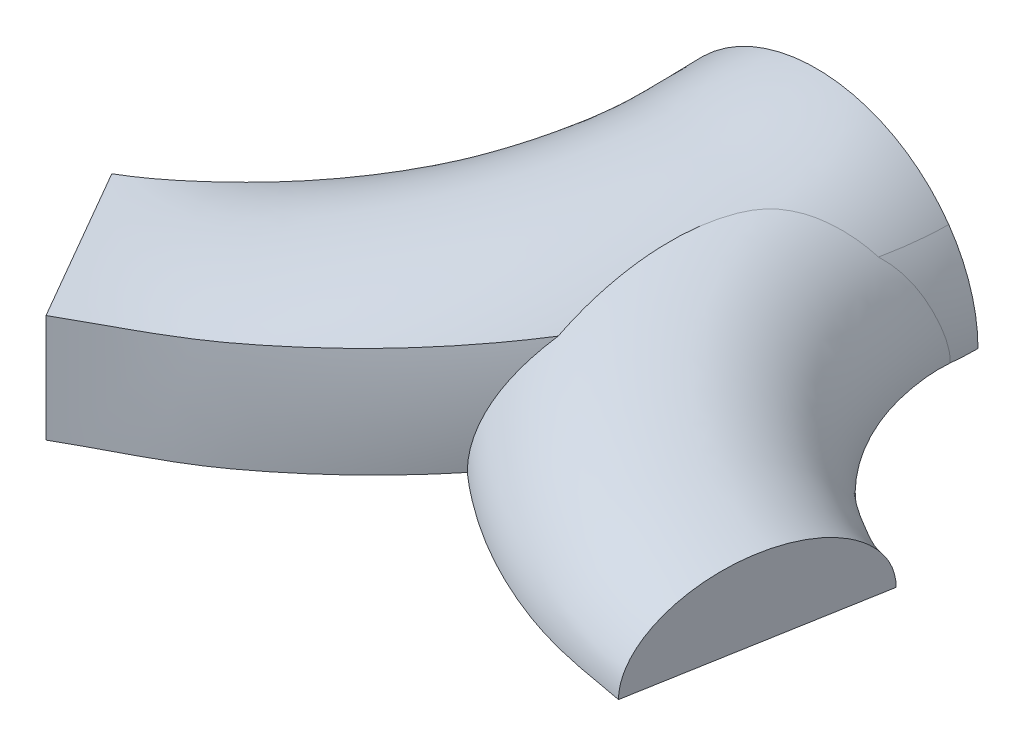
ISO-10303-21;
HEADER;
FILE_DESCRIPTION(('STEP AP214'),'2;1');
FILE_NAME('part.step','',(''),(''),'','','');
FILE_SCHEMA(('AUTOMOTIVE_DESIGN { 1 0 10303 214 1 1 1 1 }'));
ENDSEC;
DATA;
#1=APPLICATION_CONTEXT('core data for automotive mechanical design processes');
#2=APPLICATION_PROTOCOL_DEFINITION('international standard','automotive_design',2000,#1);
#3=PRODUCT_CONTEXT('',#1,'mechanical');
#4=PRODUCT('Part','Part','',(#3));
#5=PRODUCT_RELATED_PRODUCT_CATEGORY('part','',(#4));
#6=PRODUCT_DEFINITION_FORMATION('','',#4);
#7=PRODUCT_DEFINITION_CONTEXT('part definition',#1,'design');
#8=PRODUCT_DEFINITION('design','',#6,#7);
#9=PRODUCT_DEFINITION_SHAPE('','',#8);
#10=(LENGTH_UNIT() NAMED_UNIT(*) SI_UNIT(.MILLI.,.METRE.));
#11=(NAMED_UNIT(*) PLANE_ANGLE_UNIT() SI_UNIT($,.RADIAN.));
#12=(NAMED_UNIT(*) SI_UNIT($,.STERADIAN.) SOLID_ANGLE_UNIT());
#13=UNCERTAINTY_MEASURE_WITH_UNIT(LENGTH_MEASURE(1.E-05),#10,'distance_accuracy_value','');
#14=(GEOMETRIC_REPRESENTATION_CONTEXT(3) GLOBAL_UNCERTAINTY_ASSIGNED_CONTEXT((#13)) GLOBAL_UNIT_ASSIGNED_CONTEXT((#10,
#11,#12)) REPRESENTATION_CONTEXT('',''));
#15=CARTESIAN_POINT('',(0.,0.,0.));
#16=DIRECTION('',(0.,0.,1.));
#17=DIRECTION('',(1.,0.,0.));
#18=AXIS2_PLACEMENT_3D('',#15,#16,#17);
#19=CARTESIAN_POINT('',(0.,0.,-130.));
#20=DIRECTION('',(0.,0.,1.));
#21=DIRECTION('',(1.,0.,0.));
#22=AXIS2_PLACEMENT_3D('',#19,#20,#21);
#23=PLANE('',#22);
#24=CARTESIAN_POINT('',(0.,0.,-130.));
#25=DIRECTION('',(0.,0.,-1.));
#26=DIRECTION('',(1.,0.,0.));
#27=AXIS2_PLACEMENT_3D('',#24,#25,#26);
#28=CIRCLE('',#27,67.5);
#29=CARTESIAN_POINT('',(-67.5,0.,-130.));
#30=VERTEX_POINT('',#29);
#31=CARTESIAN_POINT('',(-55.2929061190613,38.7165096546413,-130.));
#32=VERTEX_POINT('',#31);
#33=EDGE_CURVE('E1146',#30,#32,#28,.T.);
#34=ORIENTED_EDGE('',*,*,#33,.T.);
#35=CARTESIAN_POINT('',(55.2928989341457,38.7165046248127,-130.));
#36=VERTEX_POINT('',#35);
#37=EDGE_CURVE('E1185',#32,#36,#28,.T.);
#38=ORIENTED_EDGE('',*,*,#37,.T.);
#39=CARTESIAN_POINT('',(0.,0.,-130.));
#40=DIRECTION('',(0.,0.,-1.));
#41=DIRECTION('',(-1.,0.,0.));
#42=AXIS2_PLACEMENT_3D('',#39,#40,#41);
#43=CIRCLE('',#42,67.5);
#44=CARTESIAN_POINT('',(67.5,0.,-130.));
#45=VERTEX_POINT('',#44);
#46=EDGE_CURVE('E1067',#36,#45,#43,.T.);
#47=ORIENTED_EDGE('',*,*,#46,.T.);
#48=DIRECTION('',(-1.,0.,0.));
#49=VECTOR('',#48,1.);
#50=CARTESIAN_POINT('',(-67.5,0.,-130.));
#51=LINE('',#50,#49);
#52=EDGE_CURVE('E1200',#45,#30,#51,.T.);
#53=ORIENTED_EDGE('',*,*,#52,.T.);
#54=EDGE_LOOP('',(#34,#38,#47,#53));
#55=FACE_BOUND('',#54,.T.);
#56=ADVANCED_FACE('F970',(#55),#23,.F.);
#57=CARTESIAN_POINT('',(128.025007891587,0.,22.5742630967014));
#58=DIRECTION('',(0.984807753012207,0.,0.173648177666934));
#59=DIRECTION('',(0.173648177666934,0.,-0.984807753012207));
#60=AXIS2_PLACEMENT_3D('',#57,#58,#59);
#61=PLANE('',#60);
#62=CARTESIAN_POINT('',(128.025007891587,0.,22.5742630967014));
#63=DIRECTION('',(0.984807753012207,0.,0.173648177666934));
#64=DIRECTION('',(0.173648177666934,0.,-0.984807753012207));
#65=AXIS2_PLACEMENT_3D('',#62,#63,#64);
#66=ELLIPSE('',#65,50.,32.5);
#67=CARTESIAN_POINT('',(136.707416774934,0.,-26.6661245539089));
#68=VERTEX_POINT('',#67);
#69=CARTESIAN_POINT('',(119.34259900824,0.,71.8146507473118));
#70=VERTEX_POINT('',#69);
#71=EDGE_CURVE('E1069',#68,#70,#66,.T.);
#72=ORIENTED_EDGE('',*,*,#71,.T.);
#73=DIRECTION('',(0.173648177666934,0.,-0.984807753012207));
#74=VECTOR('',#73,1.);
#75=CARTESIAN_POINT('',(119.34259900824,0.,71.8146507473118));
#76=LINE('',#75,#74);
#77=EDGE_CURVE('E1259',#70,#68,#76,.T.);
#78=ORIENTED_EDGE('',*,*,#77,.T.);
#79=EDGE_LOOP('',(#72,#78));
#80=FACE_BOUND('',#79,.T.);
#81=ADVANCED_FACE('F1214',(#80),#61,.T.);
#82=CARTESIAN_POINT('',(136.707416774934,0.,-26.666124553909));
#83=DIRECTION('',(0.,-1.,0.));
#84=DIRECTION('',(-0.173648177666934,0.,0.984807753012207));
#85=AXIS2_PLACEMENT_3D('',#82,#83,#84);
#86=PLANE('',#85);
#87=CARTESIAN_POINT('',(119.34259900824,0.,71.8146507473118));
#88=CARTESIAN_POINT('',(105.481389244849,0.,69.3705454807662));
#89=CARTESIAN_POINT('',(87.752954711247,0.,66.441618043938));
#90=CARTESIAN_POINT('',(61.0911805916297,0.,56.6748383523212));
#91=CARTESIAN_POINT('',(41.0460165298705,0.,47.0561121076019));
#92=CARTESIAN_POINT('',(20.2379799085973,0.,33.3808767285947));
#93=CARTESIAN_POINT('',(-0.194670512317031,0.,16.7753242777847));
#94=CARTESIAN_POINT('',(-17.6613820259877,0.,-1.71692254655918));
#95=CARTESIAN_POINT('',(-33.3198586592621,0.,-23.387955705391));
#96=CARTESIAN_POINT('',(-46.1094422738,0.,-45.5288595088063));
#97=CARTESIAN_POINT('',(-55.0384749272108,0.,-66.9932525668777));
#98=CARTESIAN_POINT('',(-63.4518017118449,0.,-95.6702842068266));
#99=CARTESIAN_POINT('',(-67.5,0.,-114.909514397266));
#100=CARTESIAN_POINT('',(-67.5,0.,-130.));
#101=B_SPLINE_CURVE_WITH_KNOTS('',3,(#87,#88,#89,#90,#91,#92,#93,#94,#95,#96,#97,#98,#99,#100),
.UNSPECIFIED.,.F.,.F.,(4,1,1,1,1,1,1,1,1,1,1,4),(0.,0.14654930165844,0.186579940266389,
0.293245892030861,0.373281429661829,0.439989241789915,0.559965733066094,0.626675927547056,
0.706716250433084,0.813393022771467,0.853428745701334,1.),.UNSPECIFIED.);
#102=CARTESIAN_POINT('',(5.72328921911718,0.,21.3007182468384));
#103=VERTEX_POINT('',#102);
#104=EDGE_CURVE('E1066',#70,#103,#101,.T.);
#105=ORIENTED_EDGE('',*,*,#104,.T.);
#106=CARTESIAN_POINT('',(-93.8333024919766,0.,97.4759526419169));
#107=CARTESIAN_POINT('',(-78.7925063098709,0.,88.7921449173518));
#108=CARTESIAN_POINT('',(-60.0546947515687,0.,80.5284913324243));
#109=CARTESIAN_POINT('',(-31.7093545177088,0.,59.6126947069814));
#110=CARTESIAN_POINT('',(-13.5647854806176,0.,43.5152363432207));
#111=CARTESIAN_POINT('',(8.16582516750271,0.,18.9913608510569));
#112=CARTESIAN_POINT('',(22.7100045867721,0.,-1.08426415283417));
#113=CARTESIAN_POINT('',(39.5235838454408,0.,-29.955746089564));
#114=CARTESIAN_POINT('',(49.7651083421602,0.,-53.2015144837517));
#115=CARTESIAN_POINT('',(61.0846789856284,0.,-88.8570564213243));
#116=CARTESIAN_POINT('',(67.5,0.,-111.05418291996));
#117=CARTESIAN_POINT('',(67.5,0.,-130.));
#118=B_SPLINE_CURVE_WITH_KNOTS('',3,(#106,#107,#108,#109,#110,#111,#112,#113,#114,#115,#116,
#117),.UNSPECIFIED.,.F.,.F.,(4,1,1,1,1,1,1,1,1,4),(0.,0.186567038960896,0.219934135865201,
0.373263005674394,0.439986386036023,0.560031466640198,0.626754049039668,0.780078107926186,
0.813443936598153,1.),.UNSPECIFIED.);
#119=CARTESIAN_POINT('',(-93.8333024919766,0.,97.4759526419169));
#120=VERTEX_POINT('',#119);
#121=EDGE_CURVE('E1055',#120,#103,#118,.T.);
#122=ORIENTED_EDGE('',*,*,#121,.F.);
#123=DIRECTION('',(0.500000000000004,0.,0.866025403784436));
#124=VECTOR('',#123,1.);
#125=CARTESIAN_POINT('',(-93.8333024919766,0.,97.4759526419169));
#126=LINE('',#125,#124);
#127=CARTESIAN_POINT('',(-131.333302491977,0.,32.5240473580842));
#128=VERTEX_POINT('',#127);
#129=EDGE_CURVE('E1037',#128,#120,#126,.T.);
#130=ORIENTED_EDGE('',*,*,#129,.F.);
#131=CARTESIAN_POINT('',(-131.333302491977,0.,32.5240473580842));
#132=CARTESIAN_POINT('',(-120.792700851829,0.,26.4384281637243));
#133=CARTESIAN_POINT('',(-111.422337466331,0.,14.53441598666));
#134=CARTESIAN_POINT('',(-96.3271454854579,0.,-3.91849403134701));
#135=CARTESIAN_POINT('',(-87.6048957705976,0.,-17.4722266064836));
#136=CARTESIAN_POINT('',(-78.2301209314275,0.,-36.3845811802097));
#137=CARTESIAN_POINT('',(-72.8052341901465,0.,-50.8963389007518));
#138=CARTESIAN_POINT('',(-67.55473919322,0.,-70.6808106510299));
#139=CARTESIAN_POINT('',(-65.5507928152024,0.,-85.5278565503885));
#140=CARTESIAN_POINT('',(-64.4964412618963,0.,-107.178083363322));
#141=CARTESIAN_POINT('',(-67.5,0.,-119.39414169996));
#142=CARTESIAN_POINT('',(-67.5,0.,-130.));
#143=B_SPLINE_CURVE_WITH_KNOTS('',3,(#131,#132,#133,#134,#135,#136,#137,#138,#139,#140,#141,
#142),.UNSPECIFIED.,.F.,.F.,(4,1,1,1,1,1,1,1,1,4),(0.,0.186567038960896,0.219934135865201,
0.373263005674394,0.439986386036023,0.560031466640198,0.626754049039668,0.780078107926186,
0.813443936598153,1.),.UNSPECIFIED.);
#144=EDGE_CURVE('E997',#30,#128,#143,.F.);
#145=ORIENTED_EDGE('',*,*,#144,.F.);
#146=ORIENTED_EDGE('',*,*,#52,.F.);
#147=CARTESIAN_POINT('',(66.9256700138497,0.,-119.009027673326));
#148=VERTEX_POINT('',#147);
#149=EDGE_CURVE('E989',#148,#45,#118,.T.);
#150=ORIENTED_EDGE('',*,*,#149,.F.);
#151=CARTESIAN_POINT('',(136.707416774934,0.,-26.666124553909));
#152=CARTESIAN_POINT('',(129.699069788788,0.,-27.9018852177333));
#153=CARTESIAN_POINT('',(121.405992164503,0.,-32.3985834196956));
#154=CARTESIAN_POINT('',(109.258024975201,0.,-39.3569393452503));
#155=CARTESIAN_POINT('',(100.660928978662,0.,-45.7393435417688));
#156=CARTESIAN_POINT('',(92.1386644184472,0.,-53.9254771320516));
#157=CARTESIAN_POINT('',(84.2111073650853,0.,-63.3145006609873));
#158=CARTESIAN_POINT('',(78.0823992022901,0.,-72.9423089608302));
#159=CARTESIAN_POINT('',(73.0661581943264,0.,-83.7141950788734));
#160=CARTESIAN_POINT('',(69.4194665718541,0.,-94.2547975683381));
#161=CARTESIAN_POINT('',(67.5644002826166,0.,-103.775308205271));
#162=CARTESIAN_POINT('',(66.2459167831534,0.,-116.223963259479));
#163=CARTESIAN_POINT('',(67.5,0.,-123.892600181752));
#164=CARTESIAN_POINT('',(67.5,0.,-130.));
#165=B_SPLINE_CURVE_WITH_KNOTS('',3,(#151,#152,#153,#154,#155,#156,#157,#158,#159,#160,#161,
#162,#163,#164),.UNSPECIFIED.,.F.,.F.,(4,1,1,1,1,1,1,1,1,1,1,4),(0.,0.14654930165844,
0.186579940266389,0.293245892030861,0.373281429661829,0.439989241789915,0.559965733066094,
0.626675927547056,0.706716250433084,0.813393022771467,0.853428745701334,1.),.UNSPECIFIED.);
#166=EDGE_CURVE('E1195',#148,#68,#165,.F.);
#167=ORIENTED_EDGE('',*,*,#166,.T.);
#168=ORIENTED_EDGE('',*,*,#77,.F.);
#169=EDGE_LOOP('',(#105,#122,#130,#145,#146,#150,#167,#168));
#170=FACE_BOUND('',#169,.T.);
#171=ADVANCED_FACE('F1064',(#170),#86,.T.);
#172=CARTESIAN_POINT('',(119.34259900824,0.,71.8146507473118));
#173=CARTESIAN_POINT('',(105.481389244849,0.,69.3705454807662));
#174=CARTESIAN_POINT('',(87.752954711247,0.,66.4416180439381));
#175=CARTESIAN_POINT('',(61.0911805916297,0.,56.6748383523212));
#176=CARTESIAN_POINT('',(41.0460165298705,0.,47.0561121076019));
#177=CARTESIAN_POINT('',(20.2379799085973,0.,33.3808767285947));
#178=CARTESIAN_POINT('',(-0.194670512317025,0.,16.7753242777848));
#179=CARTESIAN_POINT('',(-17.6613820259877,0.,-1.71692254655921));
#180=CARTESIAN_POINT('',(-33.3198586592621,0.,-23.387955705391));
#181=CARTESIAN_POINT('',(-46.1094422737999,0.,-45.5288595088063));
#182=CARTESIAN_POINT('',(-55.0384749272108,0.,-66.9932525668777));
#183=CARTESIAN_POINT('',(-63.4518017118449,0.,-95.6702842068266));
#184=CARTESIAN_POINT('',(-67.5,0.,-114.909514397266));
#185=CARTESIAN_POINT('',(-67.5,0.,-130.));
#186=CARTESIAN_POINT('',(119.34259900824,1.1210773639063,71.8146507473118));
#187=CARTESIAN_POINT('',(105.4823739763,1.1210773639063,69.3707191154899));
#188=CARTESIAN_POINT('',(87.752843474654,0.712048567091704,66.4415984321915));
#189=CARTESIAN_POINT('',(61.0912242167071,0.847455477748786,56.6748460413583));
#190=CARTESIAN_POINT('',(41.0460048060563,0.879668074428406,47.0561100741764));
#191=CARTESIAN_POINT('',(20.2379821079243,0.946944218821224,33.3808770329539));
#192=CARTESIAN_POINT('',(-0.194671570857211,1.01056274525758,16.7753244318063));
#193=CARTESIAN_POINT('',(-17.6613818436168,1.07163718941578,-1.71692449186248));
#194=CARTESIAN_POINT('',(-33.3198587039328,1.13918016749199,-23.3879516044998));
#195=CARTESIAN_POINT('',(-46.1094422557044,1.18850647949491,-45.5288814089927));
#196=CARTESIAN_POINT('',(-55.0384749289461,1.29237786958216,-66.9931710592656));
#197=CARTESIAN_POINT('',(-63.4518017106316,1.22721346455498,-95.6704920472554));
#198=CARTESIAN_POINT('',(-67.5,2.23770080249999,-114.907674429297));
#199=CARTESIAN_POINT('',(-67.5,2.23770080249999,-130.));
#200=CARTESIAN_POINT('',(119.372986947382,3.33682743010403,71.6423121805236));
#201=CARTESIAN_POINT('',(105.514731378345,3.33682743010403,69.198727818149));
#202=CARTESIAN_POINT('',(87.7723657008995,2.19422839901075,66.3910700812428));
#203=CARTESIAN_POINT('',(61.1226575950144,2.59362078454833,56.6087992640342));
#204=CARTESIAN_POINT('',(41.08375525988,2.69790806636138,46.9983328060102));
#205=CARTESIAN_POINT('',(20.2838963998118,2.90301969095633,33.3249290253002));
#206=CARTESIAN_POINT('',(-0.141143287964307,3.09741982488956,16.7246803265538));
#207=CARTESIAN_POINT('',(-17.6006768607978,3.28504665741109,-1.76222833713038));
#208=CARTESIAN_POINT('',(-33.2519677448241,3.49148828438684,-23.4262484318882));
#209=CARTESIAN_POINT('',(-46.0376642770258,3.64508727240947,-45.5599542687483));
#210=CARTESIAN_POINT('',(-54.9545439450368,3.95398780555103,-67.0161224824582));
#211=CARTESIAN_POINT('',(-63.3848052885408,3.78080433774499,-95.6846116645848));
#212=CARTESIAN_POINT('',(-67.277838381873,6.69014618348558,-114.903994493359));
#213=CARTESIAN_POINT('',(-67.277838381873,6.69014618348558,-130.));
#214=CARTESIAN_POINT('',(119.505378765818,6.56500952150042,70.8914808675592));
#215=CARTESIAN_POINT('',(105.669034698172,6.56500952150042,68.4517600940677));
#216=CARTESIAN_POINT('',(87.8751066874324,4.58267322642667,66.1127479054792));
#217=CARTESIAN_POINT('',(61.2850189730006,5.355494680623,56.2727982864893));
#218=CARTESIAN_POINT('',(41.2797401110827,5.59085065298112,46.6969624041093));
#219=CARTESIAN_POINT('',(20.5215478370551,6.01064099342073,33.0355848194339));
#220=CARTESIAN_POINT('',(0.137463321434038,6.41459425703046,16.4608172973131));
#221=CARTESIAN_POINT('',(-17.2851365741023,6.80331309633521,-1.99751056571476));
#222=CARTESIAN_POINT('',(-32.8995514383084,7.22894421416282,-23.6252960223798));
#223=CARTESIAN_POINT('',(-45.6626374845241,7.55544267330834,-45.7213181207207));
#224=CARTESIAN_POINT('',(-54.5260218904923,8.16151881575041,-67.1357307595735));
#225=CARTESIAN_POINT('',(-63.0171784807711,7.89687130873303,-95.7571255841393));
#226=CARTESIAN_POINT('',(-66.2958247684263,13.2562804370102,-114.892460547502));
#227=CARTESIAN_POINT('',(-66.2958247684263,13.2562804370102,-130.));
#228=CARTESIAN_POINT('',(119.720226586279,9.68151958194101,69.6730183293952));
#229=CARTESIAN_POINT('',(105.9250805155,9.68151958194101,67.2405618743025));
#230=CARTESIAN_POINT('',(88.0676331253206,7.12722011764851,65.5812048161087));
#231=CARTESIAN_POINT('',(61.5829393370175,8.24885739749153,55.660976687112));
#232=CARTESIAN_POINT('',(41.6413433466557,8.63824687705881,46.1395411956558));
#233=CARTESIAN_POINT('',(20.9589880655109,9.27871745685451,32.5032360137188));
#234=CARTESIAN_POINT('',(0.652126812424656,9.90835123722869,15.9730920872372));
#235=CARTESIAN_POINT('',(-16.7027461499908,10.5074805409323,-2.43151622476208));
#236=CARTESIAN_POINT('',(-32.2496514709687,11.162540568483,-23.99269589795));
#237=CARTESIAN_POINT('',(-44.9682050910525,11.6780829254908,-46.0187690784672));
#238=CARTESIAN_POINT('',(-53.7441164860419,12.5686452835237,-67.3576042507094));
#239=CARTESIAN_POINT('',(-62.3160856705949,12.2869968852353,-95.8880188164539));
#240=CARTESIAN_POINT('',(-64.6844439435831,19.6645415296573,-114.897031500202));
#241=CARTESIAN_POINT('',(-64.6844439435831,19.6645415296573,-130.));
#242=CARTESIAN_POINT('',(120.013101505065,12.6696621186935,68.0120421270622));
#243=CARTESIAN_POINT('',(106.282543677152,12.6696621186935,65.5909743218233));
#244=CARTESIAN_POINT('',(88.3675229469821,9.82028828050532,64.7405469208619));
#245=CARTESIAN_POINT('',(62.0391501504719,11.2641048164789,54.7301993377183));
#246=CARTESIAN_POINT('',(42.1972440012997,11.8295819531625,45.2806512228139));
#247=CARTESIAN_POINT('',(21.6315301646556,12.6983361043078,31.6852437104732));
#248=CARTESIAN_POINT('',(1.44131975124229,13.5605117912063,15.2250977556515));
#249=CARTESIAN_POINT('',(-15.808596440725,14.3815442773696,-3.09763320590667));
#250=CARTESIAN_POINT('',(-31.2528486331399,15.2746533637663,-24.5565699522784));
#251=CARTESIAN_POINT('',(-43.8995116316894,15.9949081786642,-46.4749611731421));
#252=CARTESIAN_POINT('',(-52.5551904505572,17.1552490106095,-67.6992302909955));
#253=CARTESIAN_POINT('',(-61.2121248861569,16.9333851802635,-96.0859942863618));
#254=CARTESIAN_POINT('',(-62.460093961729,25.872567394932,-114.929650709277));
#255=CARTESIAN_POINT('',(-62.460093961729,25.872567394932,-130.));
#256=CARTESIAN_POINT('',(120.379574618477,15.5127416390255,65.9336698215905));
#257=CARTESIAN_POINT('',(106.73973867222,15.5127416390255,63.5285987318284));
#258=CARTESIAN_POINT('',(88.7925077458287,12.6542969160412,63.5349074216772));
#259=CARTESIAN_POINT('',(62.6763226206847,14.3916328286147,53.4373204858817));
#260=CARTESIAN_POINT('',(42.9761372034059,15.1543409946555,44.0748773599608));
#261=CARTESIAN_POINT('',(22.5744844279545,16.2605842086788,30.5389685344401));
#262=CARTESIAN_POINT('',(2.54351513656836,17.3528959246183,14.1804273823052));
#263=CARTESIAN_POINT('',(-14.5577725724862,18.4095055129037,-4.02924806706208));
#264=CARTESIAN_POINT('',(-29.8597360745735,19.5476463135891,-25.3450429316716));
#265=CARTESIAN_POINT('',(-42.4016354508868,20.487884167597,-47.1125331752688));
#266=CARTESIAN_POINT('',(-50.9058529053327,21.9009677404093,-68.1781530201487));
#267=CARTESIAN_POINT('',(-59.6352658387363,21.8188626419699,-96.3596100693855));
#268=CARTESIAN_POINT('',(-59.6447352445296,31.8324865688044,-115.003543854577));
#269=CARTESIAN_POINT('',(-59.6447352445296,31.8324865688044,-130.));
#270=CARTESIAN_POINT('',(120.815394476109,18.1950340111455,63.4620125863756));
#271=CARTESIAN_POINT('',(107.295103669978,18.1950340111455,61.0780205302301));
#272=CARTESIAN_POINT('',(89.3605402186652,15.5865984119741,61.9079163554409));
#273=CARTESIAN_POINT('',(63.5173079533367,17.5881773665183,51.7387513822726));
#274=CARTESIAN_POINT('',(44.0076824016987,18.5665272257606,42.4756692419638));
#275=CARTESIAN_POINT('',(23.8217994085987,19.9120117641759,29.0231215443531));
#276=CARTESIAN_POINT('',(4.00410569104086,21.2446661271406,12.7956007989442));
#277=CARTESIAN_POINT('',(-12.9008287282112,22.5418269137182,-5.26294914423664));
#278=CARTESIAN_POINT('',(-28.0152660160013,23.9301867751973,-26.3894848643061));
#279=CARTESIAN_POINT('',(-40.4137284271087,25.1022296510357,-47.9566716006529));
#280=CARTESIAN_POINT('',(-48.7360959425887,26.7499065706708,-68.8136394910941));
#281=CARTESIAN_POINT('',(-57.5089421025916,26.8803238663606,-96.7190915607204));
#282=CARTESIAN_POINT('',(-56.2499522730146,37.5067050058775,-115.127318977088));
#283=CARTESIAN_POINT('',(-56.2499522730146,37.5067050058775,-130.));
#284=CARTESIAN_POINT('',(121.316309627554,20.7008151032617,60.6211815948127));
#285=CARTESIAN_POINT('',(107.947533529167,20.7008151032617,58.2639056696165));
#286=CARTESIAN_POINT('',(90.0895214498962,18.5745451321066,59.8031946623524));
#287=CARTESIAN_POINT('',(64.5849776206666,20.810474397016,49.5909068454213));
#288=CARTESIAN_POINT('',(45.3215332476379,22.0201435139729,40.4364755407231));
#289=CARTESIAN_POINT('',(25.4074255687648,23.5991696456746,27.0964139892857));
#290=CARTESIAN_POINT('',(5.86848001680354,25.1949812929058,11.0271377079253));
#291=CARTESIAN_POINT('',(-10.7882979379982,26.7289920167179,-6.83532450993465));
#292=CARTESIAN_POINT('',(-25.6644344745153,28.3708987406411,-27.7212662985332));
#293=CARTESIAN_POINT('',(-37.874709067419,29.7833945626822,-49.0325602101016));
#294=CARTESIAN_POINT('',(-45.9867800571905,31.6453103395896,-69.6249670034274));
#295=CARTESIAN_POINT('',(-54.7543728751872,32.0568570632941,-97.1746380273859));
#296=CARTESIAN_POINT('',(-52.3069329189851,42.8382090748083,-115.309815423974));
#297=CARTESIAN_POINT('',(-52.3069329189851,42.8382090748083,-130.));
#298=CARTESIAN_POINT('',(121.877650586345,23.0123460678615,57.4376588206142));
#299=CARTESIAN_POINT('',(108.695587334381,23.0123460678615,55.1133054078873));
#300=CARTESIAN_POINT('',(90.9950339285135,21.5666380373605,57.1710873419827));
#301=CARTESIAN_POINT('',(65.8993111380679,24.0071865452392,46.955983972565));
#302=CARTESIAN_POINT('',(46.9427154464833,25.4573754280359,37.9175262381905));
#303=CARTESIAN_POINT('',(27.3628819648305,27.2651505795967,24.7208876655));
#304=CARTESIAN_POINT('',(8.16832016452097,29.1267449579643,8.8452272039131));
#305=CARTESIAN_POINT('',(-8.18214703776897,30.8953211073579,-8.77473250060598));
#306=CARTESIAN_POINT('',(-22.7655024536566,32.7886726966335,-29.3640734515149));
#307=CARTESIAN_POINT('',(-34.7385002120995,34.4450696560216,-50.3594412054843));
#308=CARTESIAN_POINT('',(-42.6116721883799,36.5013439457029,-70.6265340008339));
#309=CARTESIAN_POINT('',(-51.3153793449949,37.2452227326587,-97.7345280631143));
#310=CARTESIAN_POINT('',(-47.8082227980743,47.8082841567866,-115.552864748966));
#311=CARTESIAN_POINT('',(-47.8082227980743,47.8082841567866,-130.));
#312=CARTESIAN_POINT('',(122.494747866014,25.1118880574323,53.9379262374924));
#313=CARTESIAN_POINT('',(109.538045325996,25.1118880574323,51.6533099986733));
#314=CARTESIAN_POINT('',(92.0926350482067,24.5113779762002,53.9619349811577));
#315=CARTESIAN_POINT('',(67.4802979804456,27.126976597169,43.7961815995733));
#316=CARTESIAN_POINT('',(48.896250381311,28.8204068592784,34.8790507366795));
#317=CARTESIAN_POINT('',(29.7196923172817,30.8530514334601,21.8585847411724));
#318=CARTESIAN_POINT('',(10.9352909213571,32.9628437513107,6.2200571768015));
#319=CARTESIAN_POINT('',(-5.04424399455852,34.9652326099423,-11.1095246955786));
#320=CARTESIAN_POINT('',(-19.2769363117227,37.1021952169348,-31.3416065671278));
#321=CARTESIAN_POINT('',(-30.9579300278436,39.0020327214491,-51.9564820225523));
#322=CARTESIAN_POINT('',(-38.5686128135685,41.2281271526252,-71.8330171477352));
#323=CARTESIAN_POINT('',(-47.1253954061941,42.352496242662,-98.406330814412));
#324=CARTESIAN_POINT('',(-42.8383239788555,52.306900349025,-115.864579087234));
#325=CARTESIAN_POINT('',(-42.8383239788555,52.306900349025,-130.));
#326=CARTESIAN_POINT('',(123.164228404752,26.9871618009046,50.1411134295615));
#327=CARTESIAN_POINT('',(110.471419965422,26.9871618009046,47.9030288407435));
#328=CARTESIAN_POINT('',(93.3855146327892,27.3231922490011,50.1651707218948));
#329=CARTESIAN_POINT('',(69.3313560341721,30.0863733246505,40.1053711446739));
#330=CARTESIAN_POINT('',(51.1869711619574,32.0173128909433,31.3134127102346));
#331=CARTESIAN_POINT('',(32.4828492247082,34.2631236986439,18.5033986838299));
#332=CARTESIAN_POINT('',(14.1779228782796,36.6049316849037,3.14332830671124));
#333=CARTESIAN_POINT('',(-1.36578951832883,38.8311790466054,-13.8460897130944));
#334=CARTESIAN_POINT('',(-15.1891904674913,41.1981695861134,-33.659454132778));
#335=CARTESIAN_POINT('',(-26.5209379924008,43.3339430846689,-53.8281424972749));
#336=CARTESIAN_POINT('',(-33.8516978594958,45.702793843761,-73.2478294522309));
#337=CARTESIAN_POINT('',(-42.1587096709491,47.240363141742,-99.1918845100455));
#338=CARTESIAN_POINT('',(-37.5064901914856,56.2499691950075,-116.246294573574));
#339=CARTESIAN_POINT('',(-37.5064901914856,56.2499691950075,-130.));
#340=CARTESIAN_POINT('',(123.880552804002,28.6180583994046,46.0786358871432));
#341=CARTESIAN_POINT('',(111.490038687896,28.6180583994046,43.8938539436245));
#342=CARTESIAN_POINT('',(94.8771094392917,29.9173927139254,45.7688402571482));
#343=CARTESIAN_POINT('',(71.4558062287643,32.8015584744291,35.877968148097));
#344=CARTESIAN_POINT('',(53.8197385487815,34.9562635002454,27.2128297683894));
#345=CARTESIAN_POINT('',(35.6573363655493,37.3955972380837,14.6492499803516));
#346=CARTESIAN_POINT('',(17.9047654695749,39.9546880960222,-0.393270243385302));
#347=CARTESIAN_POINT('',(2.86191953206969,42.3855133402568,-16.9908236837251));
#348=CARTESIAN_POINT('',(-10.4925203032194,44.9635033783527,-36.3231848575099));
#349=CARTESIAN_POINT('',(-21.4165241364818,47.3193727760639,-55.978990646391));
#350=CARTESIAN_POINT('',(-28.4510768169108,49.8065234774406,-74.8739805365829));
#351=CARTESIAN_POINT('',(-36.3996739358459,51.76019301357,-100.094056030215));
#352=CARTESIAN_POINT('',(-31.8328880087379,59.6447271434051,-116.690240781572));
#353=CARTESIAN_POINT('',(-31.8328880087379,59.6447271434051,-130.));
#354=CARTESIAN_POINT('',(124.640583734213,29.9903531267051,41.7682862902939));
#355=CARTESIAN_POINT('',(112.585415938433,29.9903531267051,39.64263495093));
#356=CARTESIAN_POINT('',(96.5531021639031,32.2041882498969,40.8171349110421));
#357=CARTESIAN_POINT('',(73.8335198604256,35.1850550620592,31.1531963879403));
#358=CARTESIAN_POINT('',(56.7694410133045,37.5399379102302,22.6166092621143));
#359=CARTESIAN_POINT('',(39.2131458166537,40.148190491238,10.3325585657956));
#360=CARTESIAN_POINT('',(22.0796916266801,42.89950400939,-4.3553790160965));
#361=CARTESIAN_POINT('',(7.59824551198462,45.5098837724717,-20.513529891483));
#362=CARTESIAN_POINT('',(-5.23213209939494,48.2728720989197,-39.3071340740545));
#363=CARTESIAN_POINT('',(-15.6938074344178,50.8245647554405,-58.3884301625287));
#364=CARTESIAN_POINT('',(-22.4187156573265,53.406226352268,-76.6954611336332));
#365=CARTESIAN_POINT('',(-29.9037614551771,55.7521564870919,-101.105071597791));
#366=CARTESIAN_POINT('',(-25.871816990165,62.4600965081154,-117.184082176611));
#367=CARTESIAN_POINT('',(-25.871816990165,62.4600965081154,-130.));
#368=CARTESIAN_POINT('',(125.438167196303,31.0864744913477,37.2449657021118));
#369=CARTESIAN_POINT('',(113.745968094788,31.0864744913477,35.1833155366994));
#370=CARTESIAN_POINT('',(98.3995254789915,34.0941658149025,35.3523150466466));
#371=CARTESIAN_POINT('',(76.4442309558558,37.1492378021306,25.9710369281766));
#372=CARTESIAN_POINT('',(60.0110041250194,39.6710555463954,17.56385508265));
#373=CARTESIAN_POINT('',(43.1202622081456,42.4186135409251,5.58978241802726));
#374=CARTESIAN_POINT('',(26.6665797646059,45.3267776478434,-8.70865637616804));
#375=CARTESIAN_POINT('',(12.8025377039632,48.0859171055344,-24.3840116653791));
#376=CARTESIAN_POINT('',(0.546793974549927,51.0009948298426,-42.5856312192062));
#377=CARTESIAN_POINT('',(-9.40204536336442,53.715530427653,-61.0358999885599));
#378=CARTESIAN_POINT('',(-15.8060651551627,56.3696742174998,-78.6961296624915));
#379=CARTESIAN_POINT('',(-22.7277591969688,59.0542275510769,-102.217494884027));
#380=CARTESIAN_POINT('',(-19.6659467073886,64.6844459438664,-117.712495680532));
#381=CARTESIAN_POINT('',(-19.6659467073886,64.6844459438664,-130.));
#382=CARTESIAN_POINT('',(126.271956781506,31.8906744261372,32.516309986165));
#383=CARTESIAN_POINT('',(114.960164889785,31.8906744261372,30.5217358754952));
#384=CARTESIAN_POINT('',(100.38065407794,35.5127971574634,29.4854831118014));
#385=CARTESIAN_POINT('',(79.2394998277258,38.6207683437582,20.42509423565));
#386=CARTESIAN_POINT('',(63.4836395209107,41.2686482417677,12.150073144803));
#387=CARTESIAN_POINT('',(47.3054740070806,44.1205234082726,0.509627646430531));
#388=CARTESIAN_POINT('',(31.5798405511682,47.1457945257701,-13.3718061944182));
#389=CARTESIAN_POINT('',(18.3774550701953,50.0166597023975,-28.529953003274));
#390=CARTESIAN_POINT('',(6.73645843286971,53.04550977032,-46.0973993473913));
#391=CARTESIAN_POINT('',(-2.65972240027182,55.8828874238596,-63.8720465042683));
#392=CARTESIAN_POINT('',(-8.73323813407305,58.5882237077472,-80.8381819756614));
#393=CARTESIAN_POINT('',(-15.0145040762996,61.5353304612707,-103.411623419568));
#394=CARTESIAN_POINT('',(-13.2536286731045,66.2958172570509,-118.256036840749));
#395=CARTESIAN_POINT('',(-13.2536286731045,66.2958172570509,-130.));
#396=CARTESIAN_POINT('',(127.131974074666,32.3862100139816,27.6389095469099));
#397=CARTESIAN_POINT('',(116.209567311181,32.3862100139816,25.7129945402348));
#398=CARTESIAN_POINT('',(102.461543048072,36.3856664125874,23.3221772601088));
#399=CARTESIAN_POINT('',(82.1705807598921,39.5262642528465,14.6111549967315));
#400=CARTESIAN_POINT('',(67.1266406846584,42.251759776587,6.47018292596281));
#401=CARTESIAN_POINT('',(51.6955552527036,45.1675746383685,-4.81908965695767));
#402=CARTESIAN_POINT('',(36.7338879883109,48.2658422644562,-18.2635851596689));
#403=CARTESIAN_POINT('',(24.2256790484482,51.2051517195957,-32.8790295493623));
#404=CARTESIAN_POINT('',(13.2290127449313,54.3040676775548,-49.7811621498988));
#405=CARTESIAN_POINT('',(4.41493997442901,57.2171866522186,-66.8475237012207));
#406=CARTESIAN_POINT('',(-1.32132655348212,59.9534796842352,-83.0837823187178));
#407=CARTESIAN_POINT('',(-6.90433624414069,63.0637565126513,-104.667835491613));
#408=CARTESIAN_POINT('',(-6.6953177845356,67.27785570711,-118.794545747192));
#409=CARTESIAN_POINT('',(-6.6953177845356,67.27785570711,-130.));
#410=CARTESIAN_POINT('',(128.025007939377,32.5569010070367,22.574262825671));
#411=CARTESIAN_POINT('',(117.493607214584,32.5569010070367,20.7172927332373));
#412=CARTESIAN_POINT('',(104.590388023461,36.6856504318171,17.0234419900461));
#413=CARTESIAN_POINT('',(85.1703222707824,39.8375075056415,8.65819456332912));
#414=CARTESIAN_POINT('',(70.8546231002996,42.5896941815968,0.658588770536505));
#415=CARTESIAN_POINT('',(56.188106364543,45.5273858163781,-10.2723423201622));
#416=CARTESIAN_POINT('',(42.0083222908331,48.6511236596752,-23.2695532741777));
#417=CARTESIAN_POINT('',(30.210490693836,51.613835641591,-37.3297152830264));
#418=CARTESIAN_POINT('',(19.8731541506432,54.7368562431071,-53.5508743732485));
#419=CARTESIAN_POINT('',(11.6550103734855,57.6760778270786,-69.892896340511));
#420=CARTESIAN_POINT('',(6.26296284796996,60.4227619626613,-85.3803079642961));
#421=CARTESIAN_POINT('',(1.39705741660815,63.5898572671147,-105.957253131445));
#422=CARTESIAN_POINT('',(0.,67.6110376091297,-119.311384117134));
#423=CARTESIAN_POINT('',(0.,67.6110376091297,-130.));
#424=CARTESIAN_POINT('',(128.918041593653,32.3862102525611,17.5096172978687));
#425=CARTESIAN_POINT('',(118.770782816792,32.3862102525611,15.7203817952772));
#426=CARTESIAN_POINT('',(106.720008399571,36.385666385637,10.7248433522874));
#427=CARTESIAN_POINT('',(88.1697596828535,39.526264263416,2.70518049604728));
#428=CARTESIAN_POINT('',(74.582687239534,42.2517597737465,-5.15299028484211));
#429=CARTESIAN_POINT('',(60.680642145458,45.1675746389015,-15.7255994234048));
#430=CARTESIAN_POINT('',(47.2827639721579,48.2658422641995,-28.2755129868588));
#431=CARTESIAN_POINT('',(36.1953010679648,51.20515171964,-41.780442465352));
#432=CARTESIAN_POINT('',(26.517295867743,54.3040676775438,-57.3205008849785));
#433=CARTESIAN_POINT('',(18.8950806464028,57.2171866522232,-72.9387256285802));
#434=CARTESIAN_POINT('',(13.8472522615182,59.9534796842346,-87.6751343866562));
#435=CARTESIAN_POINT('',(9.69845106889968,63.0637565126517,-107.251003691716));
#436=CARTESIAN_POINT('',(6.69531778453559,67.2778557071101,-119.789864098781));
#437=CARTESIAN_POINT('',(6.69531778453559,67.2778557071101,-130.));
#438=CARTESIAN_POINT('',(129.778059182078,31.890673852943,12.6322151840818));
#439=CARTESIAN_POINT('',(119.992036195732,31.890673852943,10.9066752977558));
#440=CARTESIAN_POINT('',(108.804077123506,35.512797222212,4.56209851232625));
#441=CARTESIAN_POINT('',(91.0995935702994,38.620768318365,-3.10897890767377));
#442=CARTESIAN_POINT('',(78.2260235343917,41.2686482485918,-10.8328192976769));
#443=CARTESIAN_POINT('',(65.0706605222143,44.1205234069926,-21.0543329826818));
#444=CARTESIAN_POINT('',(52.4368416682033,47.145794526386,-33.1672655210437));
#445=CARTESIAN_POINT('',(42.0435198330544,50.0166597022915,-46.129642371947));
#446=CARTESIAN_POINT('',(33.0098514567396,53.0455097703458,-61.0040090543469));
#447=CARTESIAN_POINT('',(25.9697425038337,55.8828874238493,-75.9155591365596));
#448=CARTESIAN_POINT('',(21.2591638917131,58.588223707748,-89.9156878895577));
#449=CARTESIAN_POINT('',(17.8086188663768,61.5353304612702,-108.520084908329));
#450=CARTESIAN_POINT('',(13.2536286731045,66.2958172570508,-120.214445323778));
#451=CARTESIAN_POINT('',(13.2536286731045,66.2958172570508,-130.));
#452=CARTESIAN_POINT('',(130.61184826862,31.0864756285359,7.90356229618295));
#453=CARTESIAN_POINT('',(121.162558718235,31.0864756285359,6.23739759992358));
#454=CARTESIAN_POINT('',(110.790139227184,34.0941656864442,-1.30386362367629));
#455=CARTESIAN_POINT('',(93.8929276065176,37.1492378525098,-8.65526294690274));
#456=CARTESIAN_POINT('',(81.6991788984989,39.6710555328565,-16.246506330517));
#457=CARTESIAN_POINT('',(69.2557747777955,42.418613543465,-26.1345129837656));
#458=CARTESIAN_POINT('',(57.3501494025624,45.3267776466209,-37.8303742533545));
#459=CARTESIAN_POINT('',(47.6184291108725,48.0859171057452,-50.2757755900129));
#460=CARTESIAN_POINT('',(39.1995178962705,51.0009948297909,-64.5153811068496));
#461=CARTESIAN_POINT('',(32.7120646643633,53.715530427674,-78.7538153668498));
#462=CARTESIAN_POINT('',(28.3319909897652,56.3696742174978,-92.0498899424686));
#463=CARTESIAN_POINT('',(25.5218739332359,59.0542275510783,-109.73423114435));
#464=CARTESIAN_POINT('',(19.6659467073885,64.6844459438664,-120.580774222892));
#465=CARTESIAN_POINT('',(19.6659467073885,64.6844459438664,-130.));
#466=CARTESIAN_POINT('',(131.409432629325,29.9903509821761,3.3802366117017));
#467=CARTESIAN_POINT('',(122.269380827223,29.9903509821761,1.76859887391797));
#468=CARTESIAN_POINT('',(112.642631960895,32.2041884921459,-6.76761242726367));
#469=CARTESIAN_POINT('',(96.5012583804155,35.1850549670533,-13.8378427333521));
#470=CARTESIAN_POINT('',(84.9413816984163,37.5399379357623,-21.2991437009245));
#471=CARTESIAN_POINT('',(73.1627711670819,40.1481904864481,-30.8773200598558));
#472=CARTESIAN_POINT('',(61.9370952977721,42.8995040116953,-42.1836015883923));
#473=CARTESIAN_POINT('',(52.8227113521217,45.5098837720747,-54.1464903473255));
#474=CARTESIAN_POINT('',(44.97844640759,48.2728720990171,-67.7933973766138));
#475=CARTESIAN_POINT('',(39.0038257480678,50.824564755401,-81.4038465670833));
#476=CARTESIAN_POINT('',(34.9446415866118,53.406226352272,-94.0410275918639));
#477=CARTESIAN_POINT('',(32.6978761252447,55.7521564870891,-110.870957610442));
#478=CARTESIAN_POINT('',(25.871816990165,62.4600965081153,-120.894037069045));
#479=CARTESIAN_POINT('',(25.871816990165,62.4600965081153,-130.));
#480=CARTESIAN_POINT('',(132.169461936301,28.618062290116,-0.930103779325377));
#481=CARTESIAN_POINT('',(123.315662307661,28.618062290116,-2.49126753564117));
#482=CARTESIAN_POINT('',(114.324170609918,29.9173922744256,-11.7183406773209));
#483=CARTESIAN_POINT('',(98.8767969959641,32.8015586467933,-18.5629979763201));
#484=CARTESIAN_POINT('',(87.8916686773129,34.9562634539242,-25.895257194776));
#485=CARTESIAN_POINT('',(76.7184709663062,37.3955972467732,-35.1940408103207));
#486=CARTESIAN_POINT('',(66.1120742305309,39.9546880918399,-46.1456601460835));
#487=CARTESIAN_POINT('',(57.5590282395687,42.3855133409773,-57.6694356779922));
#488=CARTESIAN_POINT('',(50.238836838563,44.9635033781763,-70.7768526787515));
#489=CARTESIAN_POINT('',(44.7265415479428,47.3193727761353,-83.8159171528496));
#490=CARTESIAN_POINT('',(40.9770028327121,49.8065234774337,-95.8527179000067));
#491=CARTESIAN_POINT('',(39.1937885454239,51.7601930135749,-111.906937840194));
#492=CARTESIAN_POINT('',(31.8328880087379,59.6447271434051,-121.166871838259));
#493=CARTESIAN_POINT('',(31.8328880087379,59.6447271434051,-130.));
#494=CARTESIAN_POINT('',(132.88578902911,26.9871556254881,-4.99259659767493));
#495=CARTESIAN_POINT('',(124.297842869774,26.9871556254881,-6.50688321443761));
#496=CARTESIAN_POINT('',(115.819881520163,27.3231929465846,-16.1139433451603));
#497=CARTESIAN_POINT('',(100.999632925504,30.0863730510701,-22.7906866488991));
#498=CARTESIAN_POINT('',(90.5248698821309,32.0173129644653,-29.9957599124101));
#499=CARTESIAN_POINT('',(79.8928767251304,34.2631236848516,-39.0482126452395));
#500=CARTESIAN_POINT('',(69.8389559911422,36.604931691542,-49.6822160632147));
#501=CARTESIAN_POINT('',(61.7867305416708,38.8311790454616,-60.8143781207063));
#502=CARTESIAN_POINT('',(54.935508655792,41.1981695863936,-73.4401524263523));
#503=CARTESIAN_POINT('',(49.8309547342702,43.3339430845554,-85.9690613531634));
#504=CARTESIAN_POINT('',(46.3776239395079,45.7027938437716,-97.4703252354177));
#505=CARTESIAN_POINT('',(44.9528242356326,47.2403631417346,-112.830895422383));
#506=CARTESIAN_POINT('',(37.5064901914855,56.2499691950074,-121.417950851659));
#507=CARTESIAN_POINT('',(37.5064901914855,56.2499691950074,-130.));
#508=CARTESIAN_POINT('',(133.555267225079,25.1118906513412,-8.78939611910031));
#509=CARTESIAN_POINT('',(125.217591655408,25.1118906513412,-10.2595532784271));
#510=CARTESIAN_POINT('',(117.114300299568,24.5113776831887,-19.9104375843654));
#511=CARTESIAN_POINT('',(102.85008733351,27.126976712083,-26.4816031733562));
#512=CARTESIAN_POINT('',(92.8157528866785,28.8204068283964,-33.5613670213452));
#513=CARTESIAN_POINT('',(82.6560032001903,30.8530514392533,-42.4034101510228));
#514=CARTESIAN_POINT('',(73.0816025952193,32.9628437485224,-52.7589174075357));
#515=CARTESIAN_POINT('',(65.4651824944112,34.9652326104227,-63.5510884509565));
#516=CARTESIAN_POINT('',(59.0232551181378,37.1021952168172,-75.7576988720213));
#517=CARTESIAN_POINT('',(54.2679465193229,39.0020327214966,-87.8423265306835));
#518=CARTESIAN_POINT('',(51.0945389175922,41.2281271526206,-98.8791662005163));
#519=CARTESIAN_POINT('',(49.9195099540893,42.3524962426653,-113.631675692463));
#520=CARTESIAN_POINT('',(42.8383239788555,52.3069003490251,-121.664868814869));
#521=CARTESIAN_POINT('',(42.8383239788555,52.3069003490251,-130.));
#522=CARTESIAN_POINT('',(134.172348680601,23.0124078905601,-12.2890389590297));
#523=CARTESIAN_POINT('',(126.069884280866,23.0124078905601,-13.7177220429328));
#524=CARTESIAN_POINT('',(118.210790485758,21.5666310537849,-23.1197962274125));
#525=CARTESIAN_POINT('',(104.431509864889,24.0071892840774,-29.6413247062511));
#526=CARTESIAN_POINT('',(94.7691707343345,25.457374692,-36.599863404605));
#527=CARTESIAN_POINT('',(85.0128355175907,27.2651507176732,-45.2657111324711));
#528=CARTESIAN_POINT('',(75.8485627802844,29.1267448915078,-55.3840806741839));
#529=CARTESIAN_POINT('',(68.6030873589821,30.8953211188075,-65.8859309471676));
#530=CARTESIAN_POINT('',(62.5118208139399,32.7886726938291,-77.735126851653));
#531=CARTESIAN_POINT('',(58.0485168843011,34.4450696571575,-89.439928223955));
#532=CARTESIAN_POINT('',(55.1375982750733,36.5013439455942,-100.083562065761));
#533=CARTESIAN_POINT('',(54.1094939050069,37.2452227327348,-114.308800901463));
#534=CARTESIAN_POINT('',(47.8082227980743,47.8082841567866,-121.929464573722));
#535=CARTESIAN_POINT('',(47.8082227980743,47.8082841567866,-130.));
#536=CARTESIAN_POINT('',(134.733697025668,20.700849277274,-15.4726036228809));
#537=CARTESIAN_POINT('',(126.852568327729,20.700849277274,-16.8622592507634));
#538=CARTESIAN_POINT('',(119.112391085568,18.5745412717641,-25.7525884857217));
#539=CARTESIAN_POINT('',(105.747377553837,20.8104759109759,-32.2759789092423));
#540=CARTESIAN_POINT('',(96.3899406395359,22.0201431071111,-39.1188855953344));
#541=CARTESIAN_POINT('',(86.9683692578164,23.5991697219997,-47.6412221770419));
#542=CARTESIAN_POINT('',(78.1483657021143,25.1949812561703,-57.5660047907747));
#543=CARTESIAN_POINT('',(71.2092446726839,26.7289920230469,-67.8252966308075));
#544=CARTESIAN_POINT('',(65.4107512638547,28.3708987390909,-79.3780198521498));
#545=CARTESIAN_POINT('',(61.1847263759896,29.7833945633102,-90.7663529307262));
#546=CARTESIAN_POINT('',(58.5127060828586,31.6453103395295,-101.08682662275));
#547=CARTESIAN_POINT('',(57.5484874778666,32.0568570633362,-114.864362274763));
#548=CARTESIAN_POINT('',(52.306932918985,42.8382090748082,-122.210834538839));
#549=CARTESIAN_POINT('',(52.306932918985,42.8382090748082,-130.));
#550=CARTESIAN_POINT('',(135.234624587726,18.1950217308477,-18.3135049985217));
#551=CARTESIAN_POINT('',(127.558110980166,18.1950217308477,-19.6670814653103));
#552=CARTESIAN_POINT('',(119.835372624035,15.5865997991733,-27.8583600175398));
#553=CARTESIAN_POINT('',(106.817400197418,17.5881768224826,-34.4234115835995));
#554=CARTESIAN_POINT('',(97.7031591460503,18.5665273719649,-41.1581918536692));
#555=CARTESIAN_POINT('',(88.5541140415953,19.9120117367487,-49.5679042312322));
#556=CARTESIAN_POINT('',(80.0126829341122,21.2446661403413,-59.3344972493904));
#557=CARTESIAN_POINT('',(73.3217852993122,22.541826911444,-69.3975577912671));
#558=CARTESIAN_POINT('',(67.7615803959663,23.9301867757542,-80.7100354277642));
#559=CARTESIAN_POINT('',(63.7237467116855,25.1022296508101,-91.8409954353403));
#560=CARTESIAN_POINT('',(61.2620218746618,26.7499065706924,-101.902790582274));
#561=CARTESIAN_POINT('',(60.3030567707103,26.8803238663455,-115.308086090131));
#562=CARTESIAN_POINT('',(56.2499522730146,37.5067050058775,-122.497994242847));
#563=CARTESIAN_POINT('',(56.2499522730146,37.5067050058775,-130.));
#564=CARTESIAN_POINT('',(135.670443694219,15.512732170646,-20.7851579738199));
#565=CARTESIAN_POINT('',(128.17833221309,15.512732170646,-22.1062193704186));
#566=CARTESIAN_POINT('',(120.396078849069,12.6542979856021,-29.4866436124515));
#567=CARTESIAN_POINT('',(107.661258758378,14.3916324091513,-36.1214735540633));
#568=CARTESIAN_POINT('',(98.7339321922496,15.1543411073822,-42.7575394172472));
#569=CARTESIAN_POINT('',(89.801573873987,16.2605841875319,-51.0837176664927));
#570=CARTESIAN_POINT('',(81.4732037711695,17.3528959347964,-60.719368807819));
#571=CARTESIAN_POINT('',(74.9787411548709,18.4095055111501,-70.6310670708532));
#572=CARTESIAN_POINT('',(69.6060475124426,19.5476463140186,-81.7548719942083));
#573=CARTESIAN_POINT('',(65.7116549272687,20.4878841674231,-92.6830326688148));
#574=CARTESIAN_POINT('',(63.4317787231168,21.9009677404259,-102.546095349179));
#575=CARTESIAN_POINT('',(62.4293805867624,21.8188626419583,-115.64763140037));
#576=CARTESIAN_POINT('',(59.6447352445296,31.8324865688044,-122.79825991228));
#577=CARTESIAN_POINT('',(59.6447352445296,31.8324865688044,-130.));
#578=CARTESIAN_POINT('',(136.036912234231,12.6696697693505,-22.8635043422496));
#579=CARTESIAN_POINT('',(128.705522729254,12.6696697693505,-24.15622611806));
#580=CARTESIAN_POINT('',(120.813156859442,9.82028741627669,-30.6936805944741));
#581=CARTESIAN_POINT('',(108.301532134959,11.2641051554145,-37.4138040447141));
#582=CARTESIAN_POINT('',(99.5119920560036,11.8295818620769,-43.9634647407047));
#583=CARTESIAN_POINT('',(90.7446844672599,12.698336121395,-52.2299548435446));
#584=CARTESIAN_POINT('',(82.5753239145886,13.5605117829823,-61.7640948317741));
#585=CARTESIAN_POINT('',(76.2295779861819,14.3815442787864,-71.5624337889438));
#586=CARTESIAN_POINT('',(70.999156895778,15.2746533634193,-82.543856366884));
#587=CARTESIAN_POINT('',(67.2095323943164,15.9949081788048,-93.317881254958));
#588=CARTESIAN_POINT('',(65.0811161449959,17.155249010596,-103.035151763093));
#589=CARTESIAN_POINT('',(64.0062397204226,16.933385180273,-115.895406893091));
#590=CARTESIAN_POINT('',(62.4600939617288,25.8725673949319,-123.10091138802));
#591=CARTESIAN_POINT('',(62.4600939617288,25.8725673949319,-130.));
#592=CARTESIAN_POINT('',(136.329788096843,9.68152369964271,-24.5244858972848));
#593=CARTESIAN_POINT('',(129.13282517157,9.68152369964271,-25.7935046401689));
#594=CARTESIAN_POINT('',(121.105157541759,7.12721965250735,-31.535729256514));
#595=CARTESIAN_POINT('',(108.760836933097,8.24885757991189,-38.3440356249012));
#596=CARTESIAN_POINT('',(100.067061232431,8.63824682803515,-44.8225060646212));
#597=CARTESIAN_POINT('',(91.4173825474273,9.27871746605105,-53.0479077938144));
#598=CARTESIAN_POINT('',(83.3644417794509,9.90835123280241,-62.5121508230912));
#599=CARTESIAN_POINT('',(77.1237406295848,10.5074805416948,-72.2282673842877));
#600=CARTESIAN_POINT('',(71.9959565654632,11.1625405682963,-83.1083150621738));
#601=CARTESIAN_POINT('',(68.2782271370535,11.6780829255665,-93.7709594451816));
#602=CARTESIAN_POINT('',(66.2700420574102,12.5686452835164,-103.388364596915));
#603=CARTESIAN_POINT('',(65.1102005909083,12.2869968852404,-116.063836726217));
#604=CARTESIAN_POINT('',(64.6844439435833,19.6645415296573,-123.395091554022));
#605=CARTESIAN_POINT('',(64.6844439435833,19.6645415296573,-130.));
#606=CARTESIAN_POINT('',(136.544638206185,6.56500507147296,-25.742961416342));
#607=CARTESIAN_POINT('',(129.450342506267,6.56500507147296,-26.9938771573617));
#608=CARTESIAN_POINT('',(121.290740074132,4.58267372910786,-32.0684955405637));
#609=CARTESIAN_POINT('',(109.061480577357,5.35549448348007,-38.9553771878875));
#610=CARTESIAN_POINT('',(100.427932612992,5.59085070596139,-45.3800607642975));
#611=CARTESIAN_POINT('',(91.8549600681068,6.01064098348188,-53.5802210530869));
#612=CARTESIAN_POINT('',(83.8790391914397,6.41459426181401,-62.9999340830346));
#613=CARTESIAN_POINT('',(77.7061424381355,6.80331309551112,-72.6620016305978));
#614=CARTESIAN_POINT('',(72.645853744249,7.22894421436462,-83.4762752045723));
#615=CARTESIAN_POINT('',(68.9726606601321,7.5554426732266,-94.0654261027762));
#616=CARTESIAN_POINT('',(67.0519473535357,8.16151881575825,-103.621342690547));
#617=CARTESIAN_POINT('',(65.8112934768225,7.89687130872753,-116.166413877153));
#618=CARTESIAN_POINT('',(66.2958247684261,13.2562804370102,-123.650338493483));
#619=CARTESIAN_POINT('',(66.2958247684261,13.2562804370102,-130.));
#620=CARTESIAN_POINT('',(136.677029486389,3.33682499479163,-26.4937896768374));
#621=CARTESIAN_POINT('',(129.653635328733,3.33682499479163,-27.7322035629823));
#622=CARTESIAN_POINT('',(121.387947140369,2.19422867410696,-32.3477941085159));
#623=CARTESIAN_POINT('',(109.226012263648,2.59362067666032,-39.2909949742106));
#624=CARTESIAN_POINT('',(100.623334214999,2.69790809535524,-45.6815378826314));
#625=CARTESIAN_POINT('',(92.0927209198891,2.90301968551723,-53.8695364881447));
#626=CARTESIAN_POINT('',(84.1575931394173,3.09741982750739,-63.2638450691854));
#627=CARTESIAN_POINT('',(78.0216917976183,3.28504665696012,-72.8970578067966));
#628=CARTESIAN_POINT('',(72.9982678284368,3.49148828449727,-83.675789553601));
#629=CARTESIAN_POINT('',(69.3476883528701,3.64508727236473,-94.2243036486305));
#630=CARTESIAN_POINT('',(67.4804693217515,3.95398780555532,-103.750202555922));
#631=CARTESIAN_POINT('',(66.1789203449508,3.78080433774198,-116.215336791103));
#632=CARTESIAN_POINT('',(67.2778383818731,6.69014618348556,-123.8476504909));
#633=CARTESIAN_POINT('',(67.2778383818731,6.69014618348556,-130.));
#634=CARTESIAN_POINT('',(136.707416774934,1.1210773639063,-26.6661245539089));
#635=CARTESIAN_POINT('',(129.694054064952,1.1210773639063,-27.9027696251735));
#636=CARTESIAN_POINT('',(121.406558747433,0.712048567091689,-32.398483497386));
#637=CARTESIAN_POINT('',(109.257802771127,0.847455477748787,-39.3569785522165));
#638=CARTESIAN_POINT('',(100.66098869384,0.879668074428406,-45.7393327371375));
#639=CARTESIAN_POINT('',(92.138653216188,0.946944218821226,-53.9254797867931));
#640=CARTESIAN_POINT('',(84.2111127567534,1.01056274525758,-63.3144969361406));
#641=CARTESIAN_POINT('',(78.0823982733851,1.07163718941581,-72.9423252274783));
#642=CARTESIAN_POINT('',(73.0661584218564,1.13918016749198,-83.7141615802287));
#643=CARTESIAN_POINT('',(69.4194664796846,1.18850647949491,-94.2549759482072));
#644=CARTESIAN_POINT('',(67.5644002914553,1.29237786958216,-103.774644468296));
#645=CARTESIAN_POINT('',(66.2459167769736,1.22721346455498,-116.225655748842));
#646=CARTESIAN_POINT('',(67.5,2.23770080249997,-123.877616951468));
#647=CARTESIAN_POINT('',(67.5,2.23770080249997,-130.));
#648=CARTESIAN_POINT('',(136.707416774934,0.,-26.6661245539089));
#649=CARTESIAN_POINT('',(129.699069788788,0.,-27.9018852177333));
#650=CARTESIAN_POINT('',(121.405992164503,0.,-32.3985834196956));
#651=CARTESIAN_POINT('',(109.258024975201,0.,-39.3569393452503));
#652=CARTESIAN_POINT('',(100.660928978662,0.,-45.7393435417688));
#653=CARTESIAN_POINT('',(92.1386644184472,0.,-53.9254771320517));
#654=CARTESIAN_POINT('',(84.2111073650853,0.,-63.3145006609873));
#655=CARTESIAN_POINT('',(78.0823992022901,0.,-72.9423089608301));
#656=CARTESIAN_POINT('',(73.0661581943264,0.,-83.7141950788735));
#657=CARTESIAN_POINT('',(69.419466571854,0.,-94.2547975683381));
#658=CARTESIAN_POINT('',(67.5644002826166,0.,-103.775308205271));
#659=CARTESIAN_POINT('',(66.2459167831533,0.,-116.223963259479));
#660=CARTESIAN_POINT('',(67.5,0.,-123.892600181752));
#661=CARTESIAN_POINT('',(67.5,0.,-130.));
#662=B_SPLINE_SURFACE_WITH_KNOTS('',3,3,((#172,#173,#174,#175,#176,#177,#178,#179,#180,#181,
#182,#183,#184,#185),(#186,#187,#188,#189,#190,#191,#192,#193,#194,#195,#196,#197,#198,#199),
(#200,#201,#202,#203,#204,#205,#206,#207,#208,#209,#210,#211,#212,#213),(#214,#215,#216,#217,
#218,#219,#220,#221,#222,#223,#224,#225,#226,#227),(#228,#229,#230,#231,#232,#233,#234,#235,
#236,#237,#238,#239,#240,#241),(#242,#243,#244,#245,#246,#247,#248,#249,#250,#251,#252,#253,
#254,#255),(#256,#257,#258,#259,#260,#261,#262,#263,#264,#265,#266,#267,#268,#269),(#270,#271,
#272,#273,#274,#275,#276,#277,#278,#279,#280,#281,#282,#283),(#284,#285,#286,#287,#288,#289,
#290,#291,#292,#293,#294,#295,#296,#297),(#298,#299,#300,#301,#302,#303,#304,#305,#306,#307,
#308,#309,#310,#311),(#312,#313,#314,#315,#316,#317,#318,#319,#320,#321,#322,#323,#324,#325),
(#326,#327,#328,#329,#330,#331,#332,#333,#334,#335,#336,#337,#338,#339),(#340,#341,#342,#343,
#344,#345,#346,#347,#348,#349,#350,#351,#352,#353),(#354,#355,#356,#357,#358,#359,#360,#361,
#362,#363,#364,#365,#366,#367),(#368,#369,#370,#371,#372,#373,#374,#375,#376,#377,#378,#379,
#380,#381),(#382,#383,#384,#385,#386,#387,#388,#389,#390,#391,#392,#393,#394,#395),(#396,#397,
#398,#399,#400,#401,#402,#403,#404,#405,#406,#407,#408,#409),(#410,#411,#412,#413,#414,#415,
#416,#417,#418,#419,#420,#421,#422,#423),(#424,#425,#426,#427,#428,#429,#430,#431,#432,#433,
#434,#435,#436,#437),(#438,#439,#440,#441,#442,#443,#444,#445,#446,#447,#448,#449,#450,#451),
(#452,#453,#454,#455,#456,#457,#458,#459,#460,#461,#462,#463,#464,#465),(#466,#467,#468,#469,
#470,#471,#472,#473,#474,#475,#476,#477,#478,#479),(#480,#481,#482,#483,#484,#485,#486,#487,
#488,#489,#490,#491,#492,#493),(#494,#495,#496,#497,#498,#499,#500,#501,#502,#503,#504,#505,
#506,#507),(#508,#509,#510,#511,#512,#513,#514,#515,#516,#517,#518,#519,#520,#521),(#522,#523,
#524,#525,#526,#527,#528,#529,#530,#531,#532,#533,#534,#535),(#536,#537,#538,#539,#540,#541,
#542,#543,#544,#545,#546,#547,#548,#549),(#550,#551,#552,#553,#554,#555,#556,#557,#558,#559,
#560,#561,#562,#563),(#564,#565,#566,#567,#568,#569,#570,#571,#572,#573,#574,#575,#576,#577),
(#578,#579,#580,#581,#582,#583,#584,#585,#586,#587,#588,#589,#590,#591),(#592,#593,#594,#595,
#596,#597,#598,#599,#600,#601,#602,#603,#604,#605),(#606,#607,#608,#609,#610,#611,#612,#613,
#614,#615,#616,#617,#618,#619),(#620,#621,#622,#623,#624,#625,#626,#627,#628,#629,#630,#631,
#632,#633),(#634,#635,#636,#637,#638,#639,#640,#641,#642,#643,#644,#645,#646,#647),(#648,#649,
#650,#651,#652,#653,#654,#655,#656,#657,#658,#659,#660,#661)),.UNSPECIFIED.,.F.,.F.,.F.,(4,1,1,
1,1,1,1,1,1,1,1,1,1,1,1,1,1,1,1,1,1,1,1,1,1,1,1,1,1,1,1,1,4),(4,1,1,1,1,1,1,1,1,1,1,4),(0.,
0.03125,0.0625,0.09375,0.125,0.15625,0.1875,0.21875,0.25,0.28125,0.3125,0.34375,0.375,0.40625,
0.4375,0.46875,0.5,0.53125,0.5625,0.59375,0.625,0.65625,0.6875,0.71875,0.75,0.78125,0.8125,
0.84375,0.875,0.90625,0.9375,0.96875,1.),(0.,0.14654930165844,0.186579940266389,
0.293245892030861,0.373281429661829,0.439989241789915,0.559965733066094,0.626675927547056,
0.706716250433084,0.813393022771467,0.853428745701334,1.),.UNSPECIFIED.);
#663=CARTESIAN_POINT('',(5.72328921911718,0.,21.3007182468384));
#664=CARTESIAN_POINT('',(5.72328298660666,0.37933712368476,21.3007254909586));
#665=CARTESIAN_POINT('',(5.72568145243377,0.758675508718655,21.2957212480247));
#666=CARTESIAN_POINT('',(5.73534392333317,1.51702583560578,21.2756381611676));
#667=CARTESIAN_POINT('',(5.74260796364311,1.89603777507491,21.2605592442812));
#668=CARTESIAN_POINT('',(5.76205151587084,2.65315885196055,21.2202880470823));
#669=CARTESIAN_POINT('',(5.77422788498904,3.03126841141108,21.1951022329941));
#670=CARTESIAN_POINT('',(5.80350668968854,3.786472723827,21.1346206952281));
#671=CARTESIAN_POINT('',(5.82060910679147,4.16356748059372,21.0993250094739));
#672=CARTESIAN_POINT('',(5.8792765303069,5.29264937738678,20.9783371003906));
#673=CARTESIAN_POINT('',(5.92820868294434,6.04270581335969,20.8775295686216));
#674=CARTESIAN_POINT('',(6.0448917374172,7.53005069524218,20.6370395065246));
#675=CARTESIAN_POINT('',(6.11251990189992,8.26739018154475,20.4976105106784));
#676=CARTESIAN_POINT('',(6.26604996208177,9.73196161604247,20.1805071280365));
#677=CARTESIAN_POINT('',(6.35195397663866,10.4591923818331,20.0028283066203));
#678=CARTESIAN_POINT('',(6.54096975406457,11.9013749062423,19.6105938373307));
#679=CARTESIAN_POINT('',(6.64408233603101,12.6163260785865,19.3960364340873));
#680=CARTESIAN_POINT('',(6.86593855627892,14.0307619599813,18.932210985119));
#681=CARTESIAN_POINT('',(6.98465035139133,14.7302748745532,18.6830135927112));
#682=CARTESIAN_POINT('',(7.236931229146,16.1135244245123,18.1507777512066));
#683=CARTESIAN_POINT('',(7.37049971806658,16.7972616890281,17.8677406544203));
#684=CARTESIAN_POINT('',(7.65143129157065,18.1473991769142,17.2691850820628));
#685=CARTESIAN_POINT('',(7.79879359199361,18.8138003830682,16.9536684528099));
#686=CARTESIAN_POINT('',(8.10637175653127,20.1290436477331,16.2911396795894));
#687=CARTESIAN_POINT('',(8.26660720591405,20.7778568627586,15.9440794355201));
#688=CARTESIAN_POINT('',(8.5984472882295,22.0558664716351,15.2205130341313));
#689=CARTESIAN_POINT('',(8.77005231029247,22.685062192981,14.8440058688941));
#690=CARTESIAN_POINT('',(9.12345348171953,23.9230840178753,14.0631944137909));
#691=CARTESIAN_POINT('',(9.30525069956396,24.5319079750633,13.6588872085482));
#692=CARTESIAN_POINT('',(9.68306512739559,25.7451655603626,12.8125193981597));
#693=CARTESIAN_POINT('',(9.87933737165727,26.3490045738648,12.3697209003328));
#694=CARTESIAN_POINT('',(10.2802399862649,27.5340281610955,11.4582109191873));
#695=CARTESIAN_POINT('',(10.4848714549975,28.1152097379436,10.9894960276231));
#696=CARTESIAN_POINT('',(10.9013688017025,29.2547198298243,10.0277668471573));
#697=CARTESIAN_POINT('',(11.1132369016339,29.8130412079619,9.53474507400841));
#698=CARTESIAN_POINT('',(11.5429709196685,30.9065728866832,8.52626873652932));
#699=CARTESIAN_POINT('',(11.760836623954,31.4417840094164,8.01081497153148));
#700=CARTESIAN_POINT('',(12.2018080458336,32.4897446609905,6.95840575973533));
#701=CARTESIAN_POINT('',(12.4249196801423,33.0024667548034,6.421425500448));
#702=CARTESIAN_POINT('',(12.8752266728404,34.0048433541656,5.32799349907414));
#703=CARTESIAN_POINT('',(13.1024221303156,34.4944972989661,4.77154128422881));
#704=CARTESIAN_POINT('',(13.5599941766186,35.4506876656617,3.64075759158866));
#705=CARTESIAN_POINT('',(13.7903696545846,35.9172319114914,3.06643227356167));
#706=CARTESIAN_POINT('',(14.2536441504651,36.8275200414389,1.90105944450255));
#707=CARTESIAN_POINT('',(14.4865429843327,37.2712655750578,1.31001314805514));
#708=CARTESIAN_POINT('',(14.9102597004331,38.0554027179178,0.224734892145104));
#709=CARTESIAN_POINT('',(15.1007849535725,38.3995797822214,-0.266884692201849));
#710=CARTESIAN_POINT('',(15.4825696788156,39.0734295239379,-1.25953966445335));
#711=CARTESIAN_POINT('',(15.6738290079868,39.4031048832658,-1.76057328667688));
#712=CARTESIAN_POINT('',(16.0559433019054,40.0468087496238,-2.7692677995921));
#713=CARTESIAN_POINT('',(16.2467962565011,40.3609005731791,-3.27688908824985));
#714=CARTESIAN_POINT('',(16.6287230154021,40.9752592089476,-4.30045288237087));
#715=CARTESIAN_POINT('',(16.8197968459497,41.275524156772,-4.81639649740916));
#716=CARTESIAN_POINT('',(17.0108423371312,41.56896061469,-5.33619050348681));
#717=B_SPLINE_CURVE_WITH_KNOTS('',3,(#663,#664,#665,#666,#667,#668,#669,#670,#671,#672,#673,
#674,#675,#676,#677,#678,#679,#680,#681,#682,#683,#684,#685,#686,#687,#688,#689,#690,#691,#692,
#693,#694,#695,#696,#697,#698,#699,#700,#701,#702,#703,#704,#705,#706,#707,#708,#709,#710,#711,
#712,#713,#714,#715,#716),.UNSPECIFIED.,.F.,.F.,(4,2,2,2,2,2,2,2,2,2,2,2,2,2,2,2,2,2,2,2,2,2,2,
2,2,2,4),(0.,1.13797159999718,2.27595144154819,3.41320438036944,4.55045305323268,
6.82413527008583,9.08323165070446,11.3425900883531,13.6020560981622,15.8569794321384,
18.111812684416,20.3665178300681,22.6247207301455,24.8830009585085,27.1415183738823,
29.4629429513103,31.7846735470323,34.1071235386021,36.4294908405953,38.7546166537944,
41.0797989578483,43.404188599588,45.728409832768,47.6170986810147,49.5054367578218,
51.3853395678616,53.2654951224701),.UNSPECIFIED.);
#718=CARTESIAN_POINT('',(17.0108423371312,41.56896061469,-5.33619050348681));
#719=VERTEX_POINT('',#718);
#720=EDGE_CURVE('E14',#103,#719,#717,.T.);
#721=CARTESIAN_POINT('',(52.8114185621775,39.1335273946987,-103.18575487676));
#722=CARTESIAN_POINT('',(52.9647657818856,38.9453629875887,-103.389526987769));
#723=CARTESIAN_POINT('',(53.1182738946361,38.7546481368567,-103.590802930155));
#724=CARTESIAN_POINT('',(53.4253902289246,38.3682187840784,-103.988412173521));
#725=CARTESIAN_POINT('',(53.578998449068,38.1725043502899,-104.184745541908));
#726=CARTESIAN_POINT('',(54.0394301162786,37.578285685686,-104.766140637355));
#727=CARTESIAN_POINT('',(54.34607783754,37.17243997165,-105.143885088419));
#728=CARTESIAN_POINT('',(54.9570796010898,36.3420077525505,-105.879771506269));
#729=CARTESIAN_POINT('',(55.2614342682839,35.9174265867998,-106.237918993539));
#730=CARTESIAN_POINT('',(55.8663094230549,35.0500972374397,-106.93492062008));
#731=CARTESIAN_POINT('',(56.1668299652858,34.6073493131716,-107.273775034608));
#732=CARTESIAN_POINT('',(56.7617930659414,33.7054509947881,-107.931804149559));
#733=CARTESIAN_POINT('',(57.0562474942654,33.246338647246,-108.251020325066));
#734=CARTESIAN_POINT('',(57.6382650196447,32.3116517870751,-108.871246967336));
#735=CARTESIAN_POINT('',(57.9258274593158,31.8360757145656,-109.172255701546));
#736=CARTESIAN_POINT('',(58.3508749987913,31.1112517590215,-109.610828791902));
#737=CARTESIAN_POINT('',(58.4915107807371,30.8677290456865,-109.75486577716));
#738=CARTESIAN_POINT('',(58.7705207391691,30.377014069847,-110.038829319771));
#739=CARTESIAN_POINT('',(58.908894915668,30.1298218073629,-110.178755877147));
#740=CARTESIAN_POINT('',(59.1831908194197,29.6319390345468,-110.454533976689));
#741=CARTESIAN_POINT('',(59.3191132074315,29.3812495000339,-110.590386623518));
#742=CARTESIAN_POINT('',(59.5884019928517,28.8763972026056,-110.858103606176));
#743=CARTESIAN_POINT('',(59.7217683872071,28.6222344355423,-110.989967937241));
#744=CARTESIAN_POINT('',(60.1408562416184,27.8100557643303,-111.402371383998));
#745=CARTESIAN_POINT('',(60.4215678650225,27.2457301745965,-111.675650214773));
#746=CARTESIAN_POINT('',(60.9689228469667,26.1023433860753,-112.204957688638));
#747=CARTESIAN_POINT('',(61.2355652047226,25.523281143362,-112.460985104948));
#748=CARTESIAN_POINT('',(61.7537078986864,24.3516410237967,-112.957718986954));
#749=CARTESIAN_POINT('',(62.0052017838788,23.7590575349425,-113.198418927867));
#750=CARTESIAN_POINT('',(62.4920821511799,22.5618041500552,-113.66679107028));
#751=CARTESIAN_POINT('',(62.7274594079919,21.9571275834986,-113.894455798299));
#752=CARTESIAN_POINT('',(63.0677866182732,21.0424204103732,-114.228235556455));
#753=CARTESIAN_POINT('',(63.1791318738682,20.7361592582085,-114.338235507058));
#754=CARTESIAN_POINT('',(63.3974828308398,20.1213134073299,-114.556038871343));
#755=CARTESIAN_POINT('',(63.5044885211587,19.8127287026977,-114.663842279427));
#756=CARTESIAN_POINT('',(63.7141648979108,19.1932467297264,-114.87772168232));
#757=CARTESIAN_POINT('',(63.8168326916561,18.8823480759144,-114.983796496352));
#758=CARTESIAN_POINT('',(64.0177010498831,18.2585702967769,-115.194339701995));
#759=CARTESIAN_POINT('',(64.1159016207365,17.9456911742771,-115.298808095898));
#760=CARTESIAN_POINT('',(64.3077468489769,17.3180168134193,-115.505917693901));
#761=CARTESIAN_POINT('',(64.4013924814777,17.0032220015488,-115.608559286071));
#762=CARTESIAN_POINT('',(64.5840800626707,16.3716711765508,-115.811875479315));
#763=CARTESIAN_POINT('',(64.6731220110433,16.0549151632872,-115.912550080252));
#764=CARTESIAN_POINT('',(64.933151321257,15.1020146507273,-116.211212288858));
#765=CARTESIAN_POINT('',(65.0971410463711,14.4629145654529,-116.405945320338));
#766=CARTESIAN_POINT('',(65.4057187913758,13.1772442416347,-116.784388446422));
#767=CARTESIAN_POINT('',(65.5503181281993,12.5306786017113,-116.96810493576));
#768=CARTESIAN_POINT('',(65.8194816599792,11.2298985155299,-117.321745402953));
#769=CARTESIAN_POINT('',(65.9440542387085,10.5756873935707,-117.491675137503));
#770=CARTESIAN_POINT('',(66.1239653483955,9.53868049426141,-117.745589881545));
#771=CARTESIAN_POINT('',(66.1862513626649,9.15851405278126,-117.83544605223));
#772=CARTESIAN_POINT('',(66.3037508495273,8.39553489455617,-118.008219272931));
#773=CARTESIAN_POINT('',(66.358964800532,8.01272235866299,-118.091136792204));
#774=CARTESIAN_POINT('',(66.4621281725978,7.24441386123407,-118.248869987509));
#775=CARTESIAN_POINT('',(66.5100769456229,6.85891766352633,-118.323684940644));
#776=CARTESIAN_POINT('',(66.5983276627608,6.08679712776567,-118.463687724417));
#777=CARTESIAN_POINT('',(66.638657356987,5.70018230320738,-118.528910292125));
#778=CARTESIAN_POINT('',(66.7116791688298,4.92461327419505,-118.648841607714));
#779=CARTESIAN_POINT('',(66.7443715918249,4.53565916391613,-118.703550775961));
#780=CARTESIAN_POINT('',(66.8018767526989,3.7557358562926,-118.800899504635));
#781=CARTESIAN_POINT('',(66.8266914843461,3.3647671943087,-118.843542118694));
#782=CARTESIAN_POINT('',(66.8605131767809,2.72649188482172,-118.901877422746));
#783=CARTESIAN_POINT('',(66.8719695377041,2.47968635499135,-118.921699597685));
#784=CARTESIAN_POINT('',(66.891622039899,1.9855674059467,-118.955573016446));
#785=CARTESIAN_POINT('',(66.8998184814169,1.73825403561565,-118.969624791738));
#786=CARTESIAN_POINT('',(66.9129254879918,1.24255187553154,-118.991661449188));
#787=CARTESIAN_POINT('',(66.9178265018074,0.994162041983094,-118.999628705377));
#788=CARTESIAN_POINT('',(66.924273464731,0.497175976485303,-119.009179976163));
#789=CARTESIAN_POINT('',(66.9258188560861,0.248579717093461,-119.010762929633));
#790=CARTESIAN_POINT('',(66.9256700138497,0.,-119.009027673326));
#791=B_SPLINE_CURVE_WITH_KNOTS('',3,(#721,#722,#723,#724,#725,#726,#727,#728,#729,#730,#731,
#732,#733,#734,#735,#736,#737,#738,#739,#740,#741,#742,#743,#744,#745,#746,#747,#748,#749,#750,
#751,#752,#753,#754,#755,#756,#757,#758,#759,#760,#761,#762,#763,#764,#765,#766,#767,#768,#769,
#770,#771,#772,#773,#774,#775,#776,#777,#778,#779,#780,#781,#782,#783,#784,#785,#786,#787,#788,
#789,#790),.UNSPECIFIED.,.F.,.F.,(4,2,2,2,2,2,2,2,2,2,2,2,2,2,2,2,2,2,2,2,2,2,2,2,2,2,2,2,2,2,2,
2,2,2,4),(0.,0.950744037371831,1.9014751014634,3.80159402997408,5.70117490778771,
7.60072867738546,9.49612224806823,11.3916958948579,12.3395188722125,13.2873418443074,
14.2349054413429,15.18247017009,17.2428233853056,19.3033229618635,21.3646938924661,
23.4272350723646,24.4590162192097,25.4907999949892,26.5232612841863,27.5557211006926,
28.587958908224,29.6201967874,31.6836096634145,33.7458129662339,35.8071507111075,
36.9937690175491,38.1803070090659,39.366950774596,40.5491855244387,41.7313729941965,
42.913261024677,43.6567783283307,44.4002271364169,45.1458215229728,45.8915398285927),.UNSPECIFIED.);
#792=CARTESIAN_POINT('',(52.8114185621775,39.1335273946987,-103.18575487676));
#793=VERTEX_POINT('',#792);
#794=EDGE_CURVE('E1269',#793,#148,#791,.T.);
#795=CARTESIAN_POINT('',(17.0108423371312,41.56896061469,-5.33619050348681));
#796=CARTESIAN_POINT('',(16.9863863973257,41.8314501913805,-5.93183793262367));
#797=CARTESIAN_POINT('',(16.9631087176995,42.0895154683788,-6.52947867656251));
#798=CARTESIAN_POINT('',(16.9191731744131,42.5970516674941,-7.72848416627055));
#799=CARTESIAN_POINT('',(16.8985152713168,42.8465227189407,-8.32984885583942));
#800=CARTESIAN_POINT('',(16.860051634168,43.3375179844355,-9.53700506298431));
#801=CARTESIAN_POINT('',(16.8422504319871,43.5790290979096,-10.1428020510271));
#802=CARTESIAN_POINT('',(16.809797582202,44.053921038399,-11.3576596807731));
#803=CARTESIAN_POINT('',(16.7951459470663,44.2873018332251,-11.9667203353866));
#804=CARTESIAN_POINT('',(16.7690924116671,44.7465360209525,-13.1887124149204));
#805=CARTESIAN_POINT('',(16.7576950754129,44.9723784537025,-13.8016480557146));
#806=CARTESIAN_POINT('',(16.7383039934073,45.4164379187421,-15.0303232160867));
#807=CARTESIAN_POINT('',(16.730310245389,45.6346549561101,-15.6460627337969));
#808=CARTESIAN_POINT('',(16.7116110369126,46.2786851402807,-17.498571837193));
#809=CARTESIAN_POINT('',(16.7062168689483,46.6933726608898,-18.7392854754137));
#810=CARTESIAN_POINT('',(16.7107053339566,47.494826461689,-21.2306900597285));
#811=CARTESIAN_POINT('',(16.7205996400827,47.881571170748,-22.4813879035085));
#812=CARTESIAN_POINT('',(16.7569638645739,48.6280172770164,-24.991087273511));
#813=CARTESIAN_POINT('',(16.7834398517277,48.9877087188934,-26.2500916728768));
#814=CARTESIAN_POINT('',(16.8571035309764,49.7014041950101,-28.8502495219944));
#815=CARTESIAN_POINT('',(16.9054341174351,50.0537845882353,-30.1918170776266));
#816=CARTESIAN_POINT('',(17.0260903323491,50.7294368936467,-32.8808634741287));
#817=CARTESIAN_POINT('',(17.0984104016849,51.0527155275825,-34.2283408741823));
#818=CARTESIAN_POINT('',(17.2690120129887,51.671014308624,-36.9274541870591));
#819=CARTESIAN_POINT('',(17.3672811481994,51.9660478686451,-38.2790878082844));
#820=CARTESIAN_POINT('',(17.5925152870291,52.5281731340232,-40.9848460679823));
#821=CARTESIAN_POINT('',(17.7194610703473,52.7952833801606,-42.3389684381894));
#822=CARTESIAN_POINT('',(18.0055055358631,53.3013459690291,-45.0480668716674));
#823=CARTESIAN_POINT('',(18.1645807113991,53.54031869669,-46.4030415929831));
#824=CARTESIAN_POINT('',(18.5193300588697,53.989244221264,-49.112346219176));
#825=CARTESIAN_POINT('',(18.7149844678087,54.1992125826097,-50.4666760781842));
#826=CARTESIAN_POINT('',(19.0423632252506,54.4929463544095,-52.5096567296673));
#827=CARTESIAN_POINT('',(19.1584160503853,54.5881249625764,-53.1992088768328));
#828=CARTESIAN_POINT('',(19.4023649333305,54.7701165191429,-54.5772998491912));
#829=CARTESIAN_POINT('',(19.5302604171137,54.8569298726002,-55.2658387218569));
#830=CARTESIAN_POINT('',(19.798553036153,55.0219004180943,-56.6415629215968));
#831=CARTESIAN_POINT('',(19.9389509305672,55.1000570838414,-57.3287481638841));
#832=CARTESIAN_POINT('',(20.2327370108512,55.2474634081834,-58.7014713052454));
#833=CARTESIAN_POINT('',(20.386128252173,55.3167109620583,-59.3870087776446));
#834=CARTESIAN_POINT('',(20.7064590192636,55.4459665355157,-60.7561350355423));
#835=CARTESIAN_POINT('',(20.8734049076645,55.5059701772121,-61.4397227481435));
#836=CARTESIAN_POINT('',(21.2214202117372,55.6163423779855,-62.8046537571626));
#837=CARTESIAN_POINT('',(21.4025005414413,55.6667033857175,-63.4859948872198));
#838=CARTESIAN_POINT('',(21.7763222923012,55.7565764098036,-64.8350497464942));
#839=CARTESIAN_POINT('',(21.9688457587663,55.7962410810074,-65.5028136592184));
#840=CARTESIAN_POINT('',(22.3684951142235,55.8652029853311,-66.8346988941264));
#841=CARTESIAN_POINT('',(22.5756246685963,55.8944976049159,-67.4988192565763));
#842=CARTESIAN_POINT('',(22.8975592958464,55.9302005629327,-68.4915628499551));
#843=CARTESIAN_POINT('',(23.0067343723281,55.9407278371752,-68.8218763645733));
#844=CARTESIAN_POINT('',(23.2288942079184,55.9589552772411,-69.4813013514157));
#845=CARTESIAN_POINT('',(23.3418789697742,55.9666554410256,-69.8104128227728));
#846=CARTESIAN_POINT('',(23.5716641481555,55.9791339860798,-70.4671576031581));
#847=CARTESIAN_POINT('',(23.6884624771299,55.9839139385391,-70.7947916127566));
#848=CARTESIAN_POINT('',(23.9259463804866,55.9904756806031,-71.4486788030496));
#849=CARTESIAN_POINT('',(24.0466319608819,55.99225746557,-71.7749319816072));
#850=CARTESIAN_POINT('',(24.2920919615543,55.9926606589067,-72.4256487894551));
#851=CARTESIAN_POINT('',(24.4168635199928,55.9912842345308,-72.7501134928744));
#852=CARTESIAN_POINT('',(24.6710873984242,55.9851277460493,-73.3971659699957));
#853=CARTESIAN_POINT('',(24.8005397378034,55.9803476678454,-73.7197537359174));
#854=CARTESIAN_POINT('',(25.1966531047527,55.9604857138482,-74.6840794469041));
#855=CARTESIAN_POINT('',(25.4711378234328,55.9398825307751,-75.3225602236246));
#856=CARTESIAN_POINT('',(25.9504784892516,55.8907995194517,-76.3779258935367));
#857=CARTESIAN_POINT('',(26.1483206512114,55.8671818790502,-76.7982278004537));
#858=CARTESIAN_POINT('',(26.5565009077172,55.8111589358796,-77.6320101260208));
#859=CARTESIAN_POINT('',(26.7668356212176,55.7787560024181,-78.0454923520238));
#860=CARTESIAN_POINT('',(27.2007472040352,55.7043434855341,-78.8643307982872));
#861=CARTESIAN_POINT('',(27.4243171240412,55.6623389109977,-79.2696911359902));
#862=CARTESIAN_POINT('',(27.7700599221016,55.5914924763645,-79.8707019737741));
#863=CARTESIAN_POINT('',(27.8870177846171,55.5665753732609,-80.0698335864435));
#864=CARTESIAN_POINT('',(28.1243583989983,55.5140617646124,-80.4656879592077));
#865=CARTESIAN_POINT('',(28.2447411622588,55.4864652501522,-80.6624107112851));
#866=CARTESIAN_POINT('',(28.6107862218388,55.399617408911,-81.2488364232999));
#867=CARTESIAN_POINT('',(28.8613908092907,55.3362985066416,-81.6348758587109));
#868=CARTESIAN_POINT('',(29.3739208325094,55.1987990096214,-82.3957165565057));
#869=CARTESIAN_POINT('',(29.6358118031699,55.1246500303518,-82.7705468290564));
#870=CARTESIAN_POINT('',(30.1705857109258,54.9651741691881,-83.5102246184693));
#871=CARTESIAN_POINT('',(30.4434757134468,54.8798400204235,-83.8750654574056));
#872=CARTESIAN_POINT('',(30.999022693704,54.6979201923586,-84.5946741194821));
#873=CARTESIAN_POINT('',(31.2816848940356,54.6013284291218,-84.9494363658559));
#874=CARTESIAN_POINT('',(31.8555086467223,54.3968914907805,-85.6488631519));
#875=CARTESIAN_POINT('',(32.1466725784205,54.2890431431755,-85.9935248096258));
#876=CARTESIAN_POINT('',(32.7362098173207,54.0621576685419,-86.6727522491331));
#877=CARTESIAN_POINT('',(33.0345821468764,53.9431220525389,-87.0073193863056));
#878=CARTESIAN_POINT('',(33.7082888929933,53.6646154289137,-87.7440574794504));
#879=CARTESIAN_POINT('',(34.0852377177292,53.5022143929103,-88.1436472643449));
#880=CARTESIAN_POINT('',(34.8464178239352,53.1605555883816,-88.9280418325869));
#881=CARTESIAN_POINT('',(35.2306458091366,52.9813053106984,-89.3128530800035));
#882=CARTESIAN_POINT('',(35.8112382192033,52.699813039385,-89.8793197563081));
#883=CARTESIAN_POINT('',(36.0054663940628,52.6038852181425,-90.0663400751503));
#884=CARTESIAN_POINT('',(36.395168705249,52.4078153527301,-90.4368406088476));
#885=CARTESIAN_POINT('',(36.5906428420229,52.307673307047,-90.6203208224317));
#886=CARTESIAN_POINT('',(37.178534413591,52.0010329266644,-91.1656110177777));
#887=CARTESIAN_POINT('',(37.5724630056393,51.7883000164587,-91.5223113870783));
#888=CARTESIAN_POINT('',(38.3649515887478,51.345381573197,-92.2253023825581));
#889=CARTESIAN_POINT('',(38.7635251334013,51.1150950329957,-92.571513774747));
#890=CARTESIAN_POINT('',(39.5612632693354,50.6387572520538,-93.2522737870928));
#891=CARTESIAN_POINT('',(39.960427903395,50.3927048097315,-93.5868215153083));
#892=CARTESIAN_POINT('',(40.7579155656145,49.8853338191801,-94.2452914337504));
#893=CARTESIAN_POINT('',(41.1562384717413,49.6240131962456,-94.5692121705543));
#894=CARTESIAN_POINT('',(41.950808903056,49.0865469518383,-95.2072003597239));
#895=CARTESIAN_POINT('',(42.3470563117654,48.8104005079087,-95.5212672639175));
#896=CARTESIAN_POINT('',(43.1016148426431,48.2686456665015,-96.112741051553));
#897=CARTESIAN_POINT('',(43.4601865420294,48.0042594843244,-96.3909364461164));
#898=CARTESIAN_POINT('',(44.1740871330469,47.4636672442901,-96.9398415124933));
#899=CARTESIAN_POINT('',(44.5294162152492,47.1874618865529,-97.210551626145));
#900=CARTESIAN_POINT('',(45.2362728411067,46.6233703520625,-97.744655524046));
#901=CARTESIAN_POINT('',(45.587800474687,46.3354844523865,-98.0080494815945));
#902=CARTESIAN_POINT('',(46.1118570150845,45.8949680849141,-98.3976467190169));
#903=CARTESIAN_POINT('',(46.2860061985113,45.7466788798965,-98.5265989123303));
#904=CARTESIAN_POINT('',(46.633171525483,45.4472080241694,-98.782656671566));
#905=CARTESIAN_POINT('',(46.8061876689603,45.2960263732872,-98.9097622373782));
#906=CARTESIAN_POINT('',(47.3234307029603,44.8381940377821,-99.2883968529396));
#907=CARTESIAN_POINT('',(47.6658470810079,44.5272602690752,-99.5372400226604));
#908=CARTESIAN_POINT('',(48.3410983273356,43.8981811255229,-100.025096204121));
#909=CARTESIAN_POINT('',(48.6739991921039,43.5801708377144,-100.264192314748));
#910=CARTESIAN_POINT('',(49.3340296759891,42.9336091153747,-100.736036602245));
#911=CARTESIAN_POINT('',(49.6611591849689,42.6050574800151,-100.968784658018));
#912=CARTESIAN_POINT('',(50.3091809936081,41.9377015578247,-101.428183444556));
#913=CARTESIAN_POINT('',(50.6300732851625,41.5988972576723,-101.654834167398));
#914=CARTESIAN_POINT('',(51.2651909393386,40.9113089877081,-102.102221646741));
#915=CARTESIAN_POINT('',(51.5794165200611,40.5625253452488,-102.322958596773));
#916=CARTESIAN_POINT('',(52.2008041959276,39.855249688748,-102.758651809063));
#917=CARTESIAN_POINT('',(52.5079668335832,39.4967584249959,-102.973608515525));
#918=CARTESIAN_POINT('',(52.811418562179,39.133527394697,-103.185754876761));
#919=B_SPLINE_CURVE_WITH_KNOTS('',3,(#795,#796,#797,#798,#799,#800,#801,#802,#803,#804,#805,
#806,#807,#808,#809,#810,#811,#812,#813,#814,#815,#816,#817,#818,#819,#820,#821,#822,#823,#824,
#825,#826,#827,#828,#829,#830,#831,#832,#833,#834,#835,#836,#837,#838,#839,#840,#841,#842,#843,
#844,#845,#846,#847,#848,#849,#850,#851,#852,#853,#854,#855,#856,#857,#858,#859,#860,#861,#862,
#863,#864,#865,#866,#867,#868,#869,#870,#871,#872,#873,#874,#875,#876,#877,#878,#879,#880,#881,
#882,#883,#884,#885,#886,#887,#888,#889,#890,#891,#892,#893,#894,#895,#896,#897,#898,#899,#900,
#901,#902,#903,#904,#905,#906,#907,#908,#909,#910,#911,#912,#913,#914,#915,#916,#917,#918),
.UNSPECIFIED.,.F.,.F.,(4,2,2,2,2,2,2,2,2,2,2,2,2,2,2,2,2,2,2,2,2,2,2,2,2,2,2,2,2,2,2,2,2,2,2,2,
2,2,2,2,2,2,2,2,2,2,2,2,2,2,2,2,2,2,2,2,2,2,2,2,2,4),(0.,1.95411175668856,3.90819409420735,
5.86534638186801,7.82250641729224,9.78239794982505,11.7422881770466,15.6663820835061,
19.593473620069,23.5220032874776,27.685238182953,31.8475089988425,36.0077933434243,
40.1652975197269,44.3197709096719,48.4720061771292,50.588976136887,52.7058435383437,
54.8228395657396,56.94033480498,59.0588298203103,61.1789771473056,63.2670379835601,
65.3556246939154,66.3997389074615,67.4438538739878,68.4874065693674,69.5309608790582,
70.5737992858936,71.6166420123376,73.7017500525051,75.0969089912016,76.4916920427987,
77.8857491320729,78.5825374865,79.2793281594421,80.6726347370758,82.0619523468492,
83.4521770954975,84.8431566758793,86.2345293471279,87.6257143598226,89.3436974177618,
91.0609202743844,91.9194352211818,92.7779504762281,94.4947951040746,96.2223976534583,
97.9501320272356,99.6781017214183,101.406167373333,102.981661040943,104.557061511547,
106.132424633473,106.920131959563,107.707839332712,109.283277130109,110.839406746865,
112.395566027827,113.951727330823,115.507837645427,117.063828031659),.UNSPECIFIED.);
#920=EDGE_CURVE('E981',#719,#793,#919,.T.);
#921=ORIENTED_EDGE('',*,*,#720,.F.);
#922=ORIENTED_EDGE('',*,*,#104,.F.);
#923=ORIENTED_EDGE('',*,*,#71,.F.);
#924=ORIENTED_EDGE('',*,*,#166,.F.);
#925=ORIENTED_EDGE('',*,*,#794,.F.);
#926=ORIENTED_EDGE('',*,*,#920,.F.);
#927=EDGE_LOOP('',(#921,#922,#923,#924,#925,#926));
#928=FACE_BOUND('',#927,.T.);
#929=ADVANCED_FACE('F1113',(#928),#662,.T.);
#930=CARTESIAN_POINT('',(-131.333302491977,0.,32.5240473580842));
#931=CARTESIAN_POINT('',(-120.792700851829,0.,26.4384281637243));
#932=CARTESIAN_POINT('',(-111.422337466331,0.,14.53441598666));
#933=CARTESIAN_POINT('',(-96.3271454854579,0.,-3.91849403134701));
#934=CARTESIAN_POINT('',(-87.6048957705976,0.,-17.4722266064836));
#935=CARTESIAN_POINT('',(-78.2301209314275,0.,-36.3845811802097));
#936=CARTESIAN_POINT('',(-72.8052341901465,0.,-50.8963389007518));
#937=CARTESIAN_POINT('',(-67.55473919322,0.,-70.6808106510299));
#938=CARTESIAN_POINT('',(-65.5507928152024,0.,-85.5278565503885));
#939=CARTESIAN_POINT('',(-64.4964412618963,0.,-107.178083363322));
#940=CARTESIAN_POINT('',(-67.5,0.,-119.39414169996));
#941=CARTESIAN_POINT('',(-67.5,0.,-130.));
#942=CARTESIAN_POINT('',(-131.333302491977,3.75000000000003,32.5240473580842));
#943=CARTESIAN_POINT('',(-120.793161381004,3.75000000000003,26.4386940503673));
#944=CARTESIAN_POINT('',(-111.422305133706,3.69758576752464,14.5343973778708));
#945=CARTESIAN_POINT('',(-96.3271626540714,3.65389443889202,-3.91848419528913));
#946=CARTESIAN_POINT('',(-87.6048930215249,3.62156990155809,-17.4722269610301));
#947=CARTESIAN_POINT('',(-78.2301218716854,3.580000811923,-36.384582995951));
#948=CARTESIAN_POINT('',(-72.8052340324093,3.54905702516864,-50.8963249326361));
#949=CARTESIAN_POINT('',(-67.554739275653,3.50721923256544,-70.6808517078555));
#950=CARTESIAN_POINT('',(-65.5507928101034,3.47893541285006,-85.5275998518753));
#951=CARTESIAN_POINT('',(-64.4964412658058,3.42771305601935,-107.178566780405));
#952=CARTESIAN_POINT('',(-67.5,3.46300332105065,-119.387256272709));
#953=CARTESIAN_POINT('',(-67.5,3.46300332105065,-130.));
#954=CARTESIAN_POINT('',(-131.333302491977,11.2500000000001,32.5240473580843));
#955=CARTESIAN_POINT('',(-120.794082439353,11.2500000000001,26.4392258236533));
#956=CARTESIAN_POINT('',(-111.378861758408,11.1054999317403,14.5944430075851));
#957=CARTESIAN_POINT('',(-96.2299290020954,10.984125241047,-3.8210428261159));
#958=CARTESIAN_POINT('',(-87.4666150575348,10.8952289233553,-17.3559891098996));
#959=CARTESIAN_POINT('',(-78.0289102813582,10.7796684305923,-36.2541754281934));
#960=CARTESIAN_POINT('',(-72.553993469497,10.6933097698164,-50.764106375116));
#961=CARTESIAN_POINT('',(-67.2350399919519,10.577414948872,-70.5574608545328));
#962=CARTESIAN_POINT('',(-65.1769972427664,10.4937529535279,-85.4226866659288));
#963=CARTESIAN_POINT('',(-64.0530924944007,10.3615318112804,-107.110763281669));
#964=CARTESIAN_POINT('',(-66.9672439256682,10.3471946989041,-119.373485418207));
#965=CARTESIAN_POINT('',(-66.9672439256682,10.3471946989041,-130.));
#966=CARTESIAN_POINT('',(-131.333302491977,22.5,32.5240473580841));
#967=CARTESIAN_POINT('',(-120.799929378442,22.5,26.4426015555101));
#968=CARTESIAN_POINT('',(-111.186266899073,22.2034014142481,14.860004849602));
#969=CARTESIAN_POINT('',(-95.802828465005,21.9526621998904,-3.39292287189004));
#970=CARTESIAN_POINT('',(-86.8499423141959,21.7700117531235,-16.837369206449));
#971=CARTESIAN_POINT('',(-77.1313210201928,21.5307489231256,-35.6725088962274));
#972=CARTESIAN_POINT('',(-71.4313661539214,21.3510106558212,-50.1730369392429));
#973=CARTESIAN_POINT('',(-65.8034961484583,21.11198297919,-70.0053024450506));
#974=CARTESIAN_POINT('',(-63.5030770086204,20.9265576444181,-84.9501301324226));
#975=CARTESIAN_POINT('',(-62.0574637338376,20.677354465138,-106.809887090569));
#976=CARTESIAN_POINT('',(-64.6241142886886,20.3759049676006,-119.255720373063));
#977=CARTESIAN_POINT('',(-64.6241142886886,20.3759049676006,-130.));
#978=CARTESIAN_POINT('',(-131.333302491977,33.75,32.5240473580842));
#979=CARTESIAN_POINT('',(-120.806496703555,33.75,26.4463932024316));
#980=CARTESIAN_POINT('',(-110.86954071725,33.2350034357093,15.2966225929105));
#981=CARTESIAN_POINT('',(-95.1047052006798,32.800427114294,-2.69330916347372));
#982=CARTESIAN_POINT('',(-85.8299557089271,32.4790413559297,-15.9792299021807));
#983=CARTESIAN_POINT('',(-75.646514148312,32.0615554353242,-34.7103931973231));
#984=CARTESIAN_POINT('',(-69.5720709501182,31.7466460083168,-49.1939272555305));
#985=CARTESIAN_POINT('',(-63.4290627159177,31.3285886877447,-69.0894682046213));
#986=CARTESIAN_POINT('',(-60.7266927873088,30.998760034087,-84.1657883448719));
#987=CARTESIAN_POINT('',(-58.7353917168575,30.5712621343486,-106.309063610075));
#988=CARTESIAN_POINT('',(-60.7912618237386,29.9349074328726,-119.066592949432));
#989=CARTESIAN_POINT('',(-60.7912618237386,29.9349074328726,-130.));
#990=CARTESIAN_POINT('',(-131.333302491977,41.25,32.5240473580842));
#991=CARTESIAN_POINT('',(-120.804404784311,41.25,26.445185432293));
#992=CARTESIAN_POINT('',(-110.578770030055,40.5105796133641,15.6984112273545));
#993=CARTESIAN_POINT('',(-94.4644479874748,39.8887735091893,-2.05225970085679));
#994=CARTESIAN_POINT('',(-84.8982049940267,39.426695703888,-15.1955203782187));
#995=CARTESIAN_POINT('',(-74.2944574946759,38.8295361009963,-33.8344489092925));
#996=CARTESIAN_POINT('',(-67.8829138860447,38.3794224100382,-48.3046392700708));
#997=CARTESIAN_POINT('',(-61.2791418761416,37.7816222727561,-68.2604845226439));
#998=CARTESIAN_POINT('',(-58.2159060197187,37.3146763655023,-83.4566053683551));
#999=CARTESIAN_POINT('',(-55.7491383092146,36.696241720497,-105.86014533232));
#1000=CARTESIAN_POINT('',(-57.279060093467,35.8796832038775,-118.873806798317));
#1001=CARTESIAN_POINT('',(-57.279060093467,35.8796832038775,-130.));
#1002=CARTESIAN_POINT('',(-131.333302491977,45.,32.5240473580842));
#1003=CARTESIAN_POINT('',(-120.803358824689,45.,26.4445815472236));
#1004=CARTESIAN_POINT('',(-110.414025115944,44.1200270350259,15.9260174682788));
#1005=CARTESIAN_POINT('',(-94.1021974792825,43.381298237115,-1.68959438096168));
#1006=CARTESIAN_POINT('',(-84.3735935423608,42.832763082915,-14.7544096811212));
#1007=CARTESIAN_POINT('',(-73.5350958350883,42.1246992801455,-33.3425300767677));
#1008=CARTESIAN_POINT('',(-66.9361084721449,41.5917134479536,-47.8063353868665));
#1009=CARTESIAN_POINT('',(-60.0775138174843,40.8836542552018,-67.7971327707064));
#1010=CARTESIAN_POINT('',(-56.8138907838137,40.3351121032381,-83.0614990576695));
#1011=CARTESIAN_POINT('',(-54.0905291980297,39.5963922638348,-105.60986809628));
#1012=CARTESIAN_POINT('',(-55.2927629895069,38.7164094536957,-118.777413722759));
#1013=CARTESIAN_POINT('',(-55.2927629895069,38.7164094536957,-130.));
#1014=B_SPLINE_SURFACE_WITH_KNOTS('',3,3,((#930,#931,#932,#933,#934,#935,#936,#937,#938,#939,
#940,#941),(#942,#943,#944,#945,#946,#947,#948,#949,#950,#951,#952,#953),(#954,#955,#956,#957,
#958,#959,#960,#961,#962,#963,#964,#965),(#966,#967,#968,#969,#970,#971,#972,#973,#974,#975,
#976,#977),(#978,#979,#980,#981,#982,#983,#984,#985,#986,#987,#988,#989),(#990,#991,#992,#993,
#994,#995,#996,#997,#998,#999,#1000,#1001),(#1002,#1003,#1004,#1005,#1006,#1007,#1008,#1009,
#1010,#1011,#1012,#1013)),.UNSPECIFIED.,.F.,.F.,.F.,(4,1,1,1,4),(4,1,1,1,1,1,1,1,1,4),(0.,0.25,
0.5,0.75,1.),(0.,0.186567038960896,0.219934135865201,0.373263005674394,0.439986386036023,
0.560031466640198,0.626754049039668,0.780078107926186,0.813443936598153,1.),.UNSPECIFIED.);
#1015=DIRECTION('',(0.,-1.,0.));
#1016=VECTOR('',#1015,1.);
#1017=CARTESIAN_POINT('',(-131.333302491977,45.,32.5240473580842));
#1018=LINE('',#1017,#1016);
#1019=CARTESIAN_POINT('',(-131.333302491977,45.,32.5240473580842));
#1020=VERTEX_POINT('',#1019);
#1021=EDGE_CURVE('E1044',#1020,#128,#1018,.T.);
#1022=CARTESIAN_POINT('',(-131.333302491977,45.,32.5240473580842));
#1023=CARTESIAN_POINT('',(-120.803358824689,45.,26.4445815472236));
#1024=CARTESIAN_POINT('',(-110.414025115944,44.1200270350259,15.9260174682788));
#1025=CARTESIAN_POINT('',(-94.1021974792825,43.381298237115,-1.68959438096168));
#1026=CARTESIAN_POINT('',(-84.3735935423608,42.832763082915,-14.7544096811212));
#1027=CARTESIAN_POINT('',(-73.5350958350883,42.1246992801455,-33.3425300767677));
#1028=CARTESIAN_POINT('',(-66.9361084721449,41.5917134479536,-47.8063353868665));
#1029=CARTESIAN_POINT('',(-60.0775138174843,40.8836542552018,-67.7971327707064));
#1030=CARTESIAN_POINT('',(-56.8138907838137,40.3351121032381,-83.0614990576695));
#1031=CARTESIAN_POINT('',(-54.0905291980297,39.5963922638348,-105.60986809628));
#1032=CARTESIAN_POINT('',(-55.2927629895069,38.7164094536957,-118.777413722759));
#1033=CARTESIAN_POINT('',(-55.2927629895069,38.7164094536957,-130.));
#1034=B_SPLINE_CURVE_WITH_KNOTS('',3,(#1022,#1023,#1024,#1025,#1026,#1027,#1028,#1029,#1030,
#1031,#1032,#1033),.UNSPECIFIED.,.F.,.F.,(4,1,1,1,1,1,1,1,1,4),(0.,0.186567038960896,
0.219934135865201,0.373263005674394,0.439986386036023,0.560031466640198,0.626754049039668,
0.780078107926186,0.813443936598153,1.),.UNSPECIFIED.);
#1035=CARTESIAN_POINT('',(-55.292638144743,38.7165011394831,-129.7842515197));
#1036=VERTEX_POINT('',#1035);
#1037=EDGE_CURVE('E1173',#1020,#1036,#1034,.T.);
#1038=EDGE_CURVE('E1090',#1036,#32,#1034,.T.);
#1039=ORIENTED_EDGE('',*,*,#33,.F.);
#1040=ORIENTED_EDGE('',*,*,#144,.T.);
#1041=ORIENTED_EDGE('',*,*,#1021,.F.);
#1042=ORIENTED_EDGE('',*,*,#1037,.T.);
#1043=ORIENTED_EDGE('',*,*,#1038,.T.);
#1044=EDGE_LOOP('',(#1039,#1040,#1041,#1042,#1043));
#1045=FACE_BOUND('',#1044,.T.);
#1046=ADVANCED_FACE('F1102',(#1045),#1014,.T.);
#1047=CARTESIAN_POINT('',(-93.8333024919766,45.,97.4759526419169));
#1048=CARTESIAN_POINT('',(-78.9085052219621,45.,88.8591169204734));
#1049=CARTESIAN_POINT('',(-61.054114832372,44.1200270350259,79.1317545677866));
#1050=CARTESIAN_POINT('',(-33.9390243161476,43.381298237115,57.3865229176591));
#1051=CARTESIAN_POINT('',(-16.7953316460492,42.8327630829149,40.7969548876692));
#1052=CARTESIAN_POINT('',(3.47054147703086,42.1246992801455,15.9495126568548));
#1053=CARTESIAN_POINT('',(16.8409222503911,41.5917134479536,-4.17461227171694));
#1054=CARTESIAN_POINT('',(32.046335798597,40.8836542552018,-32.8384765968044));
#1055=CARTESIAN_POINT('',(41.0282077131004,40.3351121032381,-55.6737074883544));
#1056=CARTESIAN_POINT('',(50.6787658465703,39.5963922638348,-90.4142831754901));
#1057=CARTESIAN_POINT('',(55.2927629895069,38.7164094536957,-111.827413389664));
#1058=CARTESIAN_POINT('',(55.2927629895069,38.7164094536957,-130.));
#1059=CARTESIAN_POINT('',(-93.8333024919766,41.25,97.4759526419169));
#1060=CARTESIAN_POINT('',(-78.8926794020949,41.25,88.8499798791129));
#1061=CARTESIAN_POINT('',(-60.8904075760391,40.5105796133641,79.3599600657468));
#1062=CARTESIAN_POINT('',(-33.5762228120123,39.8887735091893,57.7488699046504));
#1063=CARTESIAN_POINT('',(-16.2708084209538,39.426695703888,41.2381200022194));
#1064=CARTESIAN_POINT('',(4.22993331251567,38.8295361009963,16.441407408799));
#1065=CARTESIAN_POINT('',(17.7877226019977,38.3794224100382,-3.67626577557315));
#1066=CARTESIAN_POINT('',(33.2479665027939,37.7816222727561,-32.3752424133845));
#1067=CARTESIAN_POINT('',(42.4302227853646,37.3146763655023,-55.2778763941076));
#1068=CARTESIAN_POINT('',(52.3373750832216,36.696241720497,-90.1653707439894));
#1069=CARTESIAN_POINT('',(57.279060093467,35.8796832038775,-111.711582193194));
#1070=CARTESIAN_POINT('',(57.279060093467,35.8796832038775,-130.));
#1071=CARTESIAN_POINT('',(-93.8333024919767,33.75,97.475952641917));
#1072=CARTESIAN_POINT('',(-78.8610277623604,33.75,88.8317057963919));
#1073=CARTESIAN_POINT('',(-60.6017122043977,33.2350034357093,79.7629472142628));
#1074=CARTESIAN_POINT('',(-32.9348636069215,32.8004271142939,58.3892827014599));
#1075=CARTESIAN_POINT('',(-15.3392341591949,32.4790413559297,42.0219383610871));
#1076=CARTESIAN_POINT('',(5.58205031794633,32.0615554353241,17.3173035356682));
#1077=CARTESIAN_POINT('',(19.4768695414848,31.7466460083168,-2.78689256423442));
#1078=CARTESIAN_POINT('',(35.3978926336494,31.3285886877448,-31.5464938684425));
#1079=CARTESIAN_POINT('',(44.9410092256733,30.9987600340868,-54.5672438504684));
#1080=CARTESIAN_POINT('',(55.3236287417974,30.5712621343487,-89.7191820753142));
#1081=CARTESIAN_POINT('',(60.7912618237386,29.9349074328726,-111.479919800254));
#1082=CARTESIAN_POINT('',(60.7912618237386,29.9349074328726,-130.));
#1083=CARTESIAN_POINT('',(-93.8333024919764,22.5,97.4759526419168));
#1084=CARTESIAN_POINT('',(-78.8233094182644,22.5,88.8099291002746));
#1085=CARTESIAN_POINT('',(-60.2880952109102,22.2034014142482,80.201360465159));
#1086=CARTESIAN_POINT('',(-32.2350893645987,21.9526621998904,59.0879426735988));
#1087=CARTESIAN_POINT('',(-14.3195119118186,21.7700117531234,42.8802390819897));
#1088=CARTESIAN_POINT('',(7.06694760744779,21.5307489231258,18.2793502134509));
#1089=CARTESIAN_POINT('',(21.3361495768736,21.3510106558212,-1.80767387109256));
#1090=CARTESIAN_POINT('',(37.7723339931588,21.11198297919,-30.6309573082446));
#1091=CARTESIAN_POINT('',(47.7173929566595,20.9265576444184,-53.7810713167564));
#1092=CARTESIAN_POINT('',(58.6457011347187,20.6773544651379,-89.2218059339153));
#1093=CARTESIAN_POINT('',(64.6241142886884,20.3759049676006,-111.241694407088));
#1094=CARTESIAN_POINT('',(64.6241142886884,20.3759049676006,-130.));
#1095=CARTESIAN_POINT('',(-93.8333024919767,11.25,97.475952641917));
#1096=CARTESIAN_POINT('',(-78.7975047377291,11.25,88.7950307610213));
#1097=CARTESIAN_POINT('',(-60.0977225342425,11.1054999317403,80.4682056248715));
#1098=CARTESIAN_POINT('',(-31.8068088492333,10.984125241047,59.5153809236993));
#1099=CARTESIAN_POINT('',(-13.7030281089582,10.8952289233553,43.3989752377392));
#1100=CARTESIAN_POINT('',(7.96460149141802,10.7796684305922,18.8609657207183));
#1101=CARTESIAN_POINT('',(22.4587660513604,10.6933097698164,-1.21651642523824));
#1102=CARTESIAN_POINT('',(39.2038835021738,10.5774149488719,-30.0790411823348));
#1103=CARTESIAN_POINT('',(49.3913128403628,10.4937529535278,-53.3070219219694));
#1104=CARTESIAN_POINT('',(60.6413301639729,10.3615318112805,-88.9237408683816));
#1105=CARTESIAN_POINT('',(66.9672439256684,10.3471946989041,-111.083892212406));
#1106=CARTESIAN_POINT('',(66.9672439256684,10.3471946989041,-130.));
#1107=CARTESIAN_POINT('',(-93.8333024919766,3.75000000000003,97.4759526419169));
#1108=CARTESIAN_POINT('',(-78.7941724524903,3.75000000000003,88.7931068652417));
#1109=CARTESIAN_POINT('',(-60.0545777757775,3.69758576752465,80.5284237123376));
#1110=CARTESIAN_POINT('',(-31.709416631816,3.65389443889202,59.6127306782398));
#1111=CARTESIAN_POINT('',(-13.5647755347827,3.62156990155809,43.5152288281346));
#1112=CARTESIAN_POINT('',(8.1658217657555,3.580000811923,18.9913662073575));
#1113=CARTESIAN_POINT('',(22.7100051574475,3.54905702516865,-1.08428470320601));
#1114=CARTESIAN_POINT('',(39.5235835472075,3.50721923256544,-29.9556867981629));
#1115=CARTESIAN_POINT('',(49.7651083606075,3.47893541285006,-53.2018837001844));
#1116=CARTESIAN_POINT('',(61.0846789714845,3.42771305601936,-88.8563611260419));
#1117=CARTESIAN_POINT('',(67.5,3.46300332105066,-111.064086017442));
#1118=CARTESIAN_POINT('',(67.5,3.46300332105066,-130.));
#1119=CARTESIAN_POINT('',(-93.8333024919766,0.,97.4759526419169));
#1120=CARTESIAN_POINT('',(-78.7925063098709,0.,88.7921449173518));
#1121=CARTESIAN_POINT('',(-60.0546947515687,0.,80.5284913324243));
#1122=CARTESIAN_POINT('',(-31.7093545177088,0.,59.6126947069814));
#1123=CARTESIAN_POINT('',(-13.5647854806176,0.,43.5152363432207));
#1124=CARTESIAN_POINT('',(8.16582516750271,0.,18.9913608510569));
#1125=CARTESIAN_POINT('',(22.7100045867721,0.,-1.08426415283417));
#1126=CARTESIAN_POINT('',(39.5235838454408,0.,-29.955746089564));
#1127=CARTESIAN_POINT('',(49.7651083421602,0.,-53.2015144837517));
#1128=CARTESIAN_POINT('',(61.0846789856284,0.,-88.8570564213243));
#1129=CARTESIAN_POINT('',(67.5,0.,-111.05418291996));
#1130=CARTESIAN_POINT('',(67.5,0.,-130.));
#1131=B_SPLINE_SURFACE_WITH_KNOTS('',3,3,((#1047,#1048,#1049,#1050,#1051,#1052,#1053,#1054,
#1055,#1056,#1057,#1058),(#1059,#1060,#1061,#1062,#1063,#1064,#1065,#1066,#1067,#1068,#1069,
#1070),(#1071,#1072,#1073,#1074,#1075,#1076,#1077,#1078,#1079,#1080,#1081,#1082),(#1083,#1084,
#1085,#1086,#1087,#1088,#1089,#1090,#1091,#1092,#1093,#1094),(#1095,#1096,#1097,#1098,#1099,
#1100,#1101,#1102,#1103,#1104,#1105,#1106),(#1107,#1108,#1109,#1110,#1111,#1112,#1113,#1114,
#1115,#1116,#1117,#1118),(#1119,#1120,#1121,#1122,#1123,#1124,#1125,#1126,#1127,#1128,#1129,
#1130)),.UNSPECIFIED.,.F.,.F.,.F.,(4,1,1,1,4),(4,1,1,1,1,1,1,1,1,4),(0.,0.25,0.5,0.75,1.),(0.,
0.186567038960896,0.219934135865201,0.373263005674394,0.439986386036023,0.560031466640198,
0.626754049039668,0.780078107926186,0.813443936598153,1.),.UNSPECIFIED.);
#1132=CARTESIAN_POINT('',(-93.8333024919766,45.,97.4759526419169));
#1133=CARTESIAN_POINT('',(-78.9085052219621,45.,88.8591169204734));
#1134=CARTESIAN_POINT('',(-61.0541148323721,44.1200270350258,79.1317545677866));
#1135=CARTESIAN_POINT('',(-33.9390243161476,43.3812982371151,57.3865229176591));
#1136=CARTESIAN_POINT('',(-16.7953316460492,42.832763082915,40.7969548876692));
#1137=CARTESIAN_POINT('',(3.47054147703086,42.1246992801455,15.9495126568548));
#1138=CARTESIAN_POINT('',(16.840922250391,41.5917134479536,-4.17461227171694));
#1139=CARTESIAN_POINT('',(32.046335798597,40.8836542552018,-32.8384765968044));
#1140=CARTESIAN_POINT('',(41.0282077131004,40.3351121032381,-55.6737074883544));
#1141=CARTESIAN_POINT('',(50.6787658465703,39.5963922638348,-90.4142831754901));
#1142=CARTESIAN_POINT('',(55.2927629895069,38.7164094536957,-111.827413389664));
#1143=CARTESIAN_POINT('',(55.2927629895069,38.7164094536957,-130.));
#1144=B_SPLINE_CURVE_WITH_KNOTS('',3,(#1132,#1133,#1134,#1135,#1136,#1137,#1138,#1139,#1140,
#1141,#1142,#1143),.UNSPECIFIED.,.F.,.F.,(4,1,1,1,1,1,1,1,1,4),(0.,0.186567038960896,
0.219934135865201,0.373263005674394,0.439986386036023,0.560031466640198,0.626754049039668,
0.780078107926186,0.813443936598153,1.),.UNSPECIFIED.);
#1145=CARTESIAN_POINT('',(-93.8333024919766,45.,97.4759526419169));
#1146=VERTEX_POINT('',#1145);
#1147=EDGE_CURVE('E1058',#1146,#719,#1144,.T.);
#1148=DIRECTION('',(0.,1.,0.));
#1149=VECTOR('',#1148,1.);
#1150=CARTESIAN_POINT('',(-93.8333024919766,0.,97.4759526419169));
#1151=LINE('',#1150,#1149);
#1152=EDGE_CURVE('E1042',#120,#1146,#1151,.T.);
#1153=ORIENTED_EDGE('',*,*,#121,.T.);
#1154=ORIENTED_EDGE('',*,*,#720,.T.);
#1155=ORIENTED_EDGE('',*,*,#1147,.F.);
#1156=ORIENTED_EDGE('',*,*,#1152,.F.);
#1157=EDGE_LOOP('',(#1153,#1154,#1155,#1156));
#1158=FACE_BOUND('',#1157,.T.);
#1159=ADVANCED_FACE('F1054',(#1158),#1131,.T.);
#1160=CARTESIAN_POINT('',(-112.583302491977,0.,65.0000000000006));
#1161=DIRECTION('',(0.866025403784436,0.,-0.500000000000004));
#1162=DIRECTION('',(-0.500000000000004,0.,-0.866025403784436));
#1163=AXIS2_PLACEMENT_3D('',#1160,#1161,#1162);
#1164=PLANE('',#1163);
#1165=ORIENTED_EDGE('',*,*,#1152,.T.);
#1166=DIRECTION('',(-0.500000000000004,0.,-0.866025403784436));
#1167=VECTOR('',#1166,1.);
#1168=CARTESIAN_POINT('',(-131.333302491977,45.,32.5240473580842));
#1169=LINE('',#1168,#1167);
#1170=EDGE_CURVE('E1059',#1146,#1020,#1169,.T.);
#1171=ORIENTED_EDGE('',*,*,#1170,.T.);
#1172=ORIENTED_EDGE('',*,*,#1021,.T.);
#1173=ORIENTED_EDGE('',*,*,#129,.T.);
#1174=EDGE_LOOP('',(#1165,#1171,#1172,#1173));
#1175=FACE_BOUND('',#1174,.T.);
#1176=ADVANCED_FACE('F1040',(#1175),#1164,.F.);
#1177=CARTESIAN_POINT('',(-131.333302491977,45.,32.5240473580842));
#1178=CARTESIAN_POINT('',(-120.803358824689,45.,26.4445815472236));
#1179=CARTESIAN_POINT('',(-110.414025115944,44.1200270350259,15.9260174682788));
#1180=CARTESIAN_POINT('',(-94.1021974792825,43.381298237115,-1.68959438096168));
#1181=CARTESIAN_POINT('',(-84.3735935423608,42.832763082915,-14.7544096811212));
#1182=CARTESIAN_POINT('',(-73.5350958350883,42.1246992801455,-33.3425300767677));
#1183=CARTESIAN_POINT('',(-66.9361084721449,41.5917134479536,-47.8063353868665));
#1184=CARTESIAN_POINT('',(-60.0775138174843,40.8836542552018,-67.7971327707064));
#1185=CARTESIAN_POINT('',(-56.8138907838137,40.3351121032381,-83.0614990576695));
#1186=CARTESIAN_POINT('',(-54.0905291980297,39.5963922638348,-105.60986809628));
#1187=CARTESIAN_POINT('',(-55.2927629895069,38.7164094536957,-118.777413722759));
#1188=CARTESIAN_POINT('',(-55.2927629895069,38.7164094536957,-130.));
#1189=CARTESIAN_POINT('',(-130.552052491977,45.,33.8772120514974));
#1190=CARTESIAN_POINT('',(-119.937233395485,45.,27.7487433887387));
#1191=CARTESIAN_POINT('',(-109.460219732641,44.4790001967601,17.1387268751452));
#1192=CARTESIAN_POINT('',(-93.0170582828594,44.0123860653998,-0.627042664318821));
#1193=CARTESIAN_POINT('',(-83.2113128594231,43.6564642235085,-13.8039616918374));
#1194=CARTESIAN_POINT('',(-72.2916758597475,43.1763577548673,-32.5494789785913));
#1195=CARTESIAN_POINT('',(-65.644543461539,42.8043255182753,-47.1367038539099));
#1196=CARTESIAN_POINT('',(-58.7440926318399,42.290491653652,-67.2943776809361));
#1197=CARTESIAN_POINT('',(-55.4539706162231,41.8947999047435,-82.6854916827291));
#1198=CARTESIAN_POINT('',(-52.7531926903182,41.288187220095,-105.418011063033));
#1199=CARTESIAN_POINT('',(-53.7139532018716,40.971183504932,-118.686924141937));
#1200=CARTESIAN_POINT('',(-53.7139532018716,40.971183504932,-130.));
#1201=CARTESIAN_POINT('',(-128.989552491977,45.,36.5835414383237));
#1202=CARTESIAN_POINT('',(-118.204982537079,45.,30.357067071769));
#1203=CARTESIAN_POINT('',(-107.524939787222,45.1557216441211,19.6022398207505));
#1204=CARTESIAN_POINT('',(-90.7871383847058,45.2118712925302,1.55775762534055));
#1205=CARTESIAN_POINT('',(-80.8005704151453,45.2298840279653,-11.8308644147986));
#1206=CARTESIAN_POINT('',(-69.6841770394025,45.1973824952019,-30.8852108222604));
#1207=CARTESIAN_POINT('',(-62.909469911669,45.1459940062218,-45.7178496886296));
#1208=CARTESIAN_POINT('',(-55.8998249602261,45.0278471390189,-66.2209542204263));
#1209=CARTESIAN_POINT('',(-52.5285852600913,44.936372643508,-81.8758990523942));
#1210=CARTESIAN_POINT('',(-49.8398322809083,44.6288761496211,-104.997974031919));
#1211=CARTESIAN_POINT('',(-50.3062111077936,45.2528317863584,-118.505944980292));
#1212=CARTESIAN_POINT('',(-50.3062111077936,45.2528317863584,-130.));
#1213=CARTESIAN_POINT('',(-126.645802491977,45.,40.6430355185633));
#1214=CARTESIAN_POINT('',(-115.58960692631,45.,34.2597380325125));
#1215=CARTESIAN_POINT('',(-104.550175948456,46.0437995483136,23.3990004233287));
#1216=CARTESIAN_POINT('',(-87.2816402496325,46.8087629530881,4.99476534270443));
#1217=CARTESIAN_POINT('',(-76.9534168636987,47.3415829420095,-8.67685541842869));
#1218=CARTESIAN_POINT('',(-65.4395570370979,47.9411568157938,-28.1729751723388));
#1219=CARTESIAN_POINT('',(-58.3926604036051,48.3505091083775,-43.3714059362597));
#1220=CARTESIAN_POINT('',(-51.1106299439,48.819133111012,-64.4100752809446));
#1221=CARTESIAN_POINT('',(-47.5409011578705,49.1684301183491,-80.4891409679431));
#1222=CARTESIAN_POINT('',(-44.7470150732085,49.3779608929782,-104.264193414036));
#1223=CARTESIAN_POINT('',(-44.5202843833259,50.9511445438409,-118.146977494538));
#1224=CARTESIAN_POINT('',(-44.5202843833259,50.9511445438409,-130.));
#1225=CARTESIAN_POINT('',(-124.302052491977,45.,44.7025295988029));
#1226=CARTESIAN_POINT('',(-112.967513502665,45.,38.1585304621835));
#1227=CARTESIAN_POINT('',(-101.512816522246,46.8015435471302,27.2833540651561));
#1228=CARTESIAN_POINT('',(-83.6348470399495,48.189053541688,8.57288570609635));
#1229=CARTESIAN_POINT('',(-72.902564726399,49.1783677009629,-5.35084184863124));
#1230=CARTESIAN_POINT('',(-60.8902242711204,50.3562821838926,-25.2634931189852));
#1231=CARTESIAN_POINT('',(-53.5032828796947,51.1897159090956,-40.8276858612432));
#1232=CARTESIAN_POINT('',(-45.808102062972,52.2098825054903,-62.4006564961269));
#1233=CARTESIAN_POINT('',(-41.9708059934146,52.9732929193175,-78.9353081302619));
#1234=CARTESIAN_POINT('',(-38.924393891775,53.7318512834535,-103.422647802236));
#1235=CARTESIAN_POINT('',(-38.1405590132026,55.8848374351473,-117.745240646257));
#1236=CARTESIAN_POINT('',(-38.1405590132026,55.8848374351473,-130.));
#1237=CARTESIAN_POINT('',(-121.958302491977,45.,48.7620236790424));
#1238=CARTESIAN_POINT('',(-110.340375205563,45.,42.0544102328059));
#1239=CARTESIAN_POINT('',(-98.4225451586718,47.4257377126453,31.2418532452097));
#1240=CARTESIAN_POINT('',(-79.8659815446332,49.3383298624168,12.2731061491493));
#1241=CARTESIAN_POINT('',(-68.6718418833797,50.7161525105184,-1.87300819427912));
#1242=CARTESIAN_POINT('',(-56.0716413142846,52.3972847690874,-22.179464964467));
#1243=CARTESIAN_POINT('',(-48.2747335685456,53.6061473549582,-38.1046633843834));
#1244=CARTESIAN_POINT('',(-40.0539406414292,55.120937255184,-60.2170040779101));
#1245=CARTESIAN_POINT('',(-35.8767332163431,56.2544700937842,-77.2304632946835));
#1246=CARTESIAN_POINT('',(-32.4315167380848,57.5479096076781,-102.482130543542));
#1247=CARTESIAN_POINT('',(-31.2396168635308,60.013450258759,-117.303993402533));
#1248=CARTESIAN_POINT('',(-31.2396168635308,60.013450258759,-130.));
#1249=CARTESIAN_POINT('',(-119.614552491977,45.,52.8215177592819));
#1250=CARTESIAN_POINT('',(-107.711131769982,45.,45.9490746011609));
#1251=CARTESIAN_POINT('',(-95.2889566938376,47.9131661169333,35.2609990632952));
#1252=CARTESIAN_POINT('',(-75.9943136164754,50.242178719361,16.0764414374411));
#1253=CARTESIAN_POINT('',(-64.2850712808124,51.9308515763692,1.736455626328));
#1254=CARTESIAN_POINT('',(-51.0192682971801,54.0186907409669,-18.94358748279));
#1255=CARTESIAN_POINT('',(-42.7404382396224,55.5423363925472,-35.2203248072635));
#1256=CARTESIAN_POINT('',(-33.9097575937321,57.473139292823,-57.8833886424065));
#1257=CARTESIAN_POINT('',(-29.3176635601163,58.9154706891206,-75.390890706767));
#1258=CARTESIAN_POINT('',(-25.3269009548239,60.6834981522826,-101.451017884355));
#1259=CARTESIAN_POINT('',(-23.9047198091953,63.2965228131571,-116.832435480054));
#1260=CARTESIAN_POINT('',(-23.9047198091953,63.2965228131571,-130.));
#1261=CARTESIAN_POINT('',(-117.270802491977,45.,56.8810118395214));
#1262=CARTESIAN_POINT('',(-105.081488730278,45.,49.8435082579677));
#1263=CARTESIAN_POINT('',(-92.122833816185,48.2627438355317,39.3255575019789));
#1264=CARTESIAN_POINT('',(-72.0455406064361,50.8949822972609,19.9571702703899));
#1265=CARTESIAN_POINT('',(-59.7820212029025,52.8121589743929,5.44412021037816));
#1266=CARTESIAN_POINT('',(-45.7900944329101,55.2010506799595,-15.5928308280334));
#1267=CARTESIAN_POINT('',(-36.9743517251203,56.9602200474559,-32.2134695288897));
#1268=CARTESIAN_POINT('',(-27.4609954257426,59.2077025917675,-55.4323187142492));
#1269=CARTESIAN_POINT('',(-22.3947948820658,60.8839024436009,-73.446139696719));
#1270=CARTESIAN_POINT('',(-17.7427879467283,63.0267188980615,-100.348402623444));
#1271=CARTESIAN_POINT('',(-16.1957451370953,65.6935948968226,-116.336859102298));
#1272=CARTESIAN_POINT('',(-16.1957451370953,65.6935948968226,-130.));
#1273=CARTESIAN_POINT('',(-114.927052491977,45.,60.940505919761));
#1274=CARTESIAN_POINT('',(-102.45283713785,45.,53.7385143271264));
#1275=CARTESIAN_POINT('',(-88.9349817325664,48.4733859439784,43.420307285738));
#1276=CARTESIAN_POINT('',(-68.0453475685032,51.2911227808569,23.8895645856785));
#1277=CARTESIAN_POINT('',(-55.2024710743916,53.3497687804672,9.21655712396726));
#1278=CARTESIAN_POINT('',(-40.441090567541,55.9249151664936,-12.1641653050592));
#1279=CARTESIAN_POINT('',(-31.0505346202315,57.8217353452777,-29.122898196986));
#1280=CARTESIAN_POINT('',(-20.7927876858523,60.2658411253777,-52.8962990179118));
#1281=CARTESIAN_POINT('',(-15.2112541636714,62.0873730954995,-71.4257835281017));
#1282=CARTESIAN_POINT('',(-9.80778620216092,64.4656738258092,-99.1933324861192));
#1283=CARTESIAN_POINT('',(-8.22431436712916,67.164206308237,-115.824198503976));
#1284=CARTESIAN_POINT('',(-8.22431436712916,67.164206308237,-130.));
#1285=CARTESIAN_POINT('',(-112.583302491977,45.,65.0000000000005));
#1286=CARTESIAN_POINT('',(-99.8261941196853,45.,57.6346800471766));
#1287=CARTESIAN_POINT('',(-85.7361577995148,48.5439730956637,47.5300914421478));
#1288=CARTESIAN_POINT('',(-64.0195022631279,51.4250272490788,27.8478241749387));
#1289=CARTESIAN_POINT('',(-50.584640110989,53.532649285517,13.0213754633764));
#1290=CARTESIAN_POINT('',(-35.0322164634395,56.1722235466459,-8.69654447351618));
#1291=CARTESIAN_POINT('',(-25.0476032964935,58.1134009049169,-25.9904637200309));
#1292=CARTESIAN_POINT('',(-14.0155836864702,60.6258042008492,-50.3178201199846));
#1293=CARTESIAN_POINT('',(-7.89284186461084,62.4978681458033,-69.3675258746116));
#1294=CARTESIAN_POINT('',(-1.70588142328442,64.9590848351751,-98.0122211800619));
#1295=CARTESIAN_POINT('',(0.,67.6678968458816,-115.300342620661));
#1296=CARTESIAN_POINT('',(0.,67.6678968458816,-130.));
#1297=CARTESIAN_POINT('',(-110.239552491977,45.,69.0594940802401));
#1298=CARTESIAN_POINT('',(-97.202314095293,45.,61.5324409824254));
#1299=CARTESIAN_POINT('',(-82.5371398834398,48.4733859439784,51.6397635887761));
#1300=CARTESIAN_POINT('',(-59.9937599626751,51.2911227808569,31.8061432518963));
#1301=CARTESIAN_POINT('',(-45.9667926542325,53.3497687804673,16.8261839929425));
#1302=CARTESIAN_POINT('',(-29.6233480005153,55.9249151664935,-5.22891983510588));
#1303=CARTESIAN_POINT('',(-19.0446710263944,57.8217353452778,-22.8580330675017));
#1304=CARTESIAN_POINT('',(-7.23838018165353,60.2658411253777,-47.7393313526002));
#1305=CARTESIAN_POINT('',(-0.574429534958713,62.0873730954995,-67.3093280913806));
#1306=CARTESIAN_POINT('',(6.39602333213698,64.4656738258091,-96.8309971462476));
#1307=CARTESIAN_POINT('',(8.22431436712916,67.1642063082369,-114.778092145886));
#1308=CARTESIAN_POINT('',(8.22431436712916,67.1642063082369,-130.));
#1309=CARTESIAN_POINT('',(-107.895802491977,45.,73.1189881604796));
#1310=CARTESIAN_POINT('',(-94.5815267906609,45.,65.4319875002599));
#1311=CARTESIAN_POINT('',(-79.3487356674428,48.2627438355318,55.7341945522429));
#1312=CARTESIAN_POINT('',(-55.993860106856,50.8949822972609,35.7387068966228));
#1313=CARTESIAN_POINT('',(-41.387195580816,52.8121589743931,20.5985928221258));
#1314=CARTESIAN_POINT('',(-24.274360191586,55.2010506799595,-1.80024316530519));
#1315=CARTESIAN_POINT('',(-13.1208512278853,56.960220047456,-19.7674744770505));
#1316=CARTESIAN_POINT('',(-0.570173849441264,59.2077025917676,-45.2032781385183));
#1317=CARTESIAN_POINT('',(6.60911127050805,60.8839024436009,-65.2891762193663));
#1318=CARTESIAN_POINT('',(14.3310250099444,63.0267188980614,-95.6755423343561));
#1319=CARTESIAN_POINT('',(16.1957451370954,65.6935948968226,-114.270909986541));
#1320=CARTESIAN_POINT('',(16.1957451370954,65.6935948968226,-130.));
#1321=CARTESIAN_POINT('',(-105.552052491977,45.,77.1784822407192));
#1322=CARTESIAN_POINT('',(-91.9639637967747,45.,69.3333955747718));
#1323=CARTESIAN_POINT('',(-76.1817646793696,47.9131661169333,59.7982632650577));
#1324=CARTESIAN_POINT('',(-52.045537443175,50.242178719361,39.6196958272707));
#1325=CARTESIAN_POINT('',(-36.8840733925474,51.9308515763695,24.3062143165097));
#1326=CARTESIAN_POINT('',(-19.0452109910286,54.0186907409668,1.55053051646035));
#1327=CARTESIAN_POINT('',(-7.35476057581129,55.5423363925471,-16.7606382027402));
#1328=CARTESIAN_POINT('',(5.8785861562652,57.4731392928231,-42.7521583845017));
#1329=CARTESIAN_POINT('',(13.5319800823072,58.9154706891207,-63.3447286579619));
#1330=CARTESIAN_POINT('',(21.9151379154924,60.6834981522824,-94.5723557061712));
#1331=CARTESIAN_POINT('',(23.9047198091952,63.2965228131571,-113.78347085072));
#1332=CARTESIAN_POINT('',(23.9047198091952,63.2965228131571,-130.));
#1333=CARTESIAN_POINT('',(-103.208302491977,45.,81.2379763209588));
#1334=CARTESIAN_POINT('',(-89.3495446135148,45.,73.2366187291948));
#1335=CARTESIAN_POINT('',(-73.0471354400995,47.4257377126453,63.8168080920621));
#1336=CARTESIAN_POINT('',(-48.174422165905,49.3383298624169,43.4233503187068));
#1337=CARTESIAN_POINT('',(-32.497214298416,50.7161525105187,27.9156249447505));
#1338=CARTESIAN_POINT('',(-13.9928682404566,52.3972847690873,4.78642949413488));
#1339=CARTESIAN_POINT('',(-1.82046016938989,53.606147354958,-13.8763265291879));
#1340=CARTESIAN_POINT('',(12.0227665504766,55.120937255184,-40.4184713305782));
#1341=CARTESIAN_POINT('',(20.0910499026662,56.2544700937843,-61.5055938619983));
#1342=CARTESIAN_POINT('',(29.0197535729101,57.547909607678,-93.5404187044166));
#1343=CARTESIAN_POINT('',(31.2396168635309,60.0134502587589,-113.323653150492));
#1344=CARTESIAN_POINT('',(31.2396168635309,60.0134502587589,-130.));
#1345=CARTESIAN_POINT('',(-100.864552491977,45.,85.2974704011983));
#1346=CARTESIAN_POINT('',(-86.7379589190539,45.,77.1414777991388));
#1347=CARTESIAN_POINT('',(-69.9557721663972,46.8015435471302,67.7746767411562));
#1348=CARTESIAN_POINT('',(-44.4061364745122,48.1890535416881,47.123905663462));
#1349=CARTESIAN_POINT('',(-28.2663986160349,49.178367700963,31.3934025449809));
#1350=CARTESIAN_POINT('',(-9.17431703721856,50.3562821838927,7.8704806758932));
#1351=CARTESIAN_POINT('',(3.40809446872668,51.1897159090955,-11.153335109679));
#1352=CARTESIAN_POINT('',(17.7769251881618,52.2098825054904,-38.2347354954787));
#1353=CARTESIAN_POINT('',(26.1851228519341,52.9732929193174,-59.8012600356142));
#1354=CARTESIAN_POINT('',(35.5126305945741,53.7318512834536,-92.5989392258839));
#1355=CARTESIAN_POINT('',(38.1405590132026,55.8848374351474,-112.896109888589));
#1356=CARTESIAN_POINT('',(38.1405590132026,55.8848374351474,-130.));
#1357=CARTESIAN_POINT('',(-98.5208024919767,45.,89.3569644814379));
#1358=CARTESIAN_POINT('',(-84.1281904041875,45.,81.0473860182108));
#1359=CARTESIAN_POINT('',(-66.9175474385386,46.0437995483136,71.6585307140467));
#1360=CARTESIAN_POINT('',(-40.7598027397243,46.8087629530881,50.7022914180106));
#1361=CARTESIAN_POINT('',(-24.2154729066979,47.3415829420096,34.7193718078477));
#1362=CARTESIAN_POINT('',(-4.62500943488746,47.9411568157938,10.7799807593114));
#1363=CARTESIAN_POINT('',(8.29747621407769,48.3505091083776,-8.60963834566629));
#1364=CARTESIAN_POINT('',(23.0794508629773,48.8191331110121,-36.2252544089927));
#1365=CARTESIAN_POINT('',(31.7552181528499,49.1684301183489,-58.2478084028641));
#1366=CARTESIAN_POINT('',(41.3352516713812,49.3779608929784,-91.7566758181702));
#1367=CARTESIAN_POINT('',(44.5202843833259,50.9511445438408,-112.504595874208));
#1368=CARTESIAN_POINT('',(44.5202843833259,50.9511445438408,-130.));
#1369=CARTESIAN_POINT('',(-96.1770524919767,45.,93.4164585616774));
#1370=CARTESIAN_POINT('',(-81.5192623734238,45.,84.9537794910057));
#1371=CARTESIAN_POINT('',(-63.9423309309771,45.1557216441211,75.4550299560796));
#1372=CARTESIAN_POINT('',(-37.2545449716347,45.2118712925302,54.139437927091));
#1373=CARTESIAN_POINT('',(-20.36828086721,45.2298840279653,37.8733583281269));
#1374=CARTESIAN_POINT('',(-0.38040259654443,45.1973824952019,13.4922244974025));
#1375=CARTESIAN_POINT('',(12.8142879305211,45.1459940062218,-6.2631987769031));
#1376=CARTESIAN_POINT('',(27.8686447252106,45.027847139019,-34.4143662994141));
#1377=CARTESIAN_POINT('',(36.7429023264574,44.9363726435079,-56.8611034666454));
#1378=CARTESIAN_POINT('',(46.4280688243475,44.6288761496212,-91.0227951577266));
#1379=CARTESIAN_POINT('',(50.3062111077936,45.2528317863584,-112.147052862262));
#1380=CARTESIAN_POINT('',(50.3062111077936,45.2528317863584,-130.));
#1381=CARTESIAN_POINT('',(-94.6145524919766,45.,96.1227879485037));
#1382=CARTESIAN_POINT('',(-79.7787576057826,45.,87.5573377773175));
#1383=CARTESIAN_POINT('',(-62.0076304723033,44.4790001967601,77.9188777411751));
#1384=CARTESIAN_POINT('',(-35.0243173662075,44.0123860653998,56.324060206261));
#1385=CARTESIAN_POINT('',(-17.9575876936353,43.6564642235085,39.8464898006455));
#1386=CARTESIAN_POINT('',(2.22711307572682,43.1763577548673,15.1564719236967));
#1387=CARTESIAN_POINT('',(15.5493586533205,42.8043255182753,-4.84427740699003));
#1388=CARTESIAN_POINT('',(30.7129138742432,42.290491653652,-33.3411354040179));
#1389=CARTESIAN_POINT('',(39.668287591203,41.8947999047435,-56.0503135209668));
#1390=CARTESIAN_POINT('',(49.341429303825,41.288187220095,-90.6050128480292));
#1391=CARTESIAN_POINT('',(53.7139532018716,40.971183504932,-111.93395988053));
#1392=CARTESIAN_POINT('',(53.7139532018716,40.971183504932,-130.));
#1393=CARTESIAN_POINT('',(-93.8333024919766,45.,97.4759526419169));
#1394=CARTESIAN_POINT('',(-78.9085052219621,45.,88.8591169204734));
#1395=CARTESIAN_POINT('',(-61.0541148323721,44.1200270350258,79.1317545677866));
#1396=CARTESIAN_POINT('',(-33.9390243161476,43.3812982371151,57.3865229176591));
#1397=CARTESIAN_POINT('',(-16.7953316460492,42.832763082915,40.7969548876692));
#1398=CARTESIAN_POINT('',(3.47054147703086,42.1246992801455,15.9495126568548));
#1399=CARTESIAN_POINT('',(16.840922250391,41.5917134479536,-4.17461227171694));
#1400=CARTESIAN_POINT('',(32.046335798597,40.8836542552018,-32.8384765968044));
#1401=CARTESIAN_POINT('',(41.0282077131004,40.3351121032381,-55.6737074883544));
#1402=CARTESIAN_POINT('',(50.6787658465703,39.5963922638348,-90.4142831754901));
#1403=CARTESIAN_POINT('',(55.2927629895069,38.7164094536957,-111.827413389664));
#1404=CARTESIAN_POINT('',(55.2927629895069,38.7164094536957,-130.));
#1405=B_SPLINE_SURFACE_WITH_KNOTS('',3,3,((#1177,#1178,#1179,#1180,#1181,#1182,#1183,#1184,
#1185,#1186,#1187,#1188),(#1189,#1190,#1191,#1192,#1193,#1194,#1195,#1196,#1197,#1198,#1199,
#1200),(#1201,#1202,#1203,#1204,#1205,#1206,#1207,#1208,#1209,#1210,#1211,#1212),(#1213,#1214,
#1215,#1216,#1217,#1218,#1219,#1220,#1221,#1222,#1223,#1224),(#1225,#1226,#1227,#1228,#1229,
#1230,#1231,#1232,#1233,#1234,#1235,#1236),(#1237,#1238,#1239,#1240,#1241,#1242,#1243,#1244,
#1245,#1246,#1247,#1248),(#1249,#1250,#1251,#1252,#1253,#1254,#1255,#1256,#1257,#1258,#1259,
#1260),(#1261,#1262,#1263,#1264,#1265,#1266,#1267,#1268,#1269,#1270,#1271,#1272),(#1273,#1274,
#1275,#1276,#1277,#1278,#1279,#1280,#1281,#1282,#1283,#1284),(#1285,#1286,#1287,#1288,#1289,
#1290,#1291,#1292,#1293,#1294,#1295,#1296),(#1297,#1298,#1299,#1300,#1301,#1302,#1303,#1304,
#1305,#1306,#1307,#1308),(#1309,#1310,#1311,#1312,#1313,#1314,#1315,#1316,#1317,#1318,#1319,
#1320),(#1321,#1322,#1323,#1324,#1325,#1326,#1327,#1328,#1329,#1330,#1331,#1332),(#1333,#1334,
#1335,#1336,#1337,#1338,#1339,#1340,#1341,#1342,#1343,#1344),(#1345,#1346,#1347,#1348,#1349,
#1350,#1351,#1352,#1353,#1354,#1355,#1356),(#1357,#1358,#1359,#1360,#1361,#1362,#1363,#1364,
#1365,#1366,#1367,#1368),(#1369,#1370,#1371,#1372,#1373,#1374,#1375,#1376,#1377,#1378,#1379,
#1380),(#1381,#1382,#1383,#1384,#1385,#1386,#1387,#1388,#1389,#1390,#1391,#1392),(#1393,#1394,
#1395,#1396,#1397,#1398,#1399,#1400,#1401,#1402,#1403,#1404)),.UNSPECIFIED.,.F.,.F.,.F.,(4,1,1,
1,1,1,1,1,1,1,1,1,1,1,1,1,4),(4,1,1,1,1,1,1,1,1,4),(0.,0.0625,0.125,0.1875,0.25,0.3125,0.375,
0.4375,0.5,0.5625,0.625,0.6875,0.75,0.8125,0.875,0.9375,1.),(0.,0.186567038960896,
0.219934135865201,0.373263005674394,0.439986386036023,0.560031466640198,0.626754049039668,
0.780078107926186,0.813443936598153,1.),.UNSPECIFIED.);
#1406=CARTESIAN_POINT('',(-93.8333024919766,45.,97.4759526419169));
#1407=CARTESIAN_POINT('',(-78.9085052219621,45.,88.8591169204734));
#1408=CARTESIAN_POINT('',(-61.0541148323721,44.1200270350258,79.1317545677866));
#1409=CARTESIAN_POINT('',(-33.9390243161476,43.3812982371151,57.3865229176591));
#1410=CARTESIAN_POINT('',(-16.7953316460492,42.832763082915,40.7969548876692));
#1411=CARTESIAN_POINT('',(3.47054147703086,42.1246992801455,15.9495126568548));
#1412=CARTESIAN_POINT('',(16.840922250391,41.5917134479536,-4.17461227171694));
#1413=CARTESIAN_POINT('',(32.046335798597,40.8836542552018,-32.8384765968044));
#1414=CARTESIAN_POINT('',(41.0282077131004,40.3351121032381,-55.6737074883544));
#1415=CARTESIAN_POINT('',(50.6787658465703,39.5963922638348,-90.4142831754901));
#1416=CARTESIAN_POINT('',(55.2927629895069,38.7164094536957,-111.827413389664));
#1417=CARTESIAN_POINT('',(55.2927629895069,38.7164094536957,-130.));
#1418=B_SPLINE_CURVE_WITH_KNOTS('',3,(#1406,#1407,#1408,#1409,#1410,#1411,#1412,#1413,#1414,
#1415,#1416,#1417),.UNSPECIFIED.,.F.,.F.,(4,1,1,1,1,1,1,1,1,4),(0.,0.186567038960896,
0.219934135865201,0.373263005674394,0.439986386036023,0.560031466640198,0.626754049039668,
0.780078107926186,0.813443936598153,1.),.UNSPECIFIED.);
#1419=EDGE_CURVE('E1158',#793,#36,#1418,.T.);
#1420=ORIENTED_EDGE('',*,*,#1147,.T.);
#1421=ORIENTED_EDGE('',*,*,#920,.T.);
#1422=ORIENTED_EDGE('',*,*,#1419,.T.);
#1423=ORIENTED_EDGE('',*,*,#37,.F.);
#1424=ORIENTED_EDGE('',*,*,#1038,.F.);
#1425=ORIENTED_EDGE('',*,*,#1037,.F.);
#1426=ORIENTED_EDGE('',*,*,#1170,.F.);
#1427=EDGE_LOOP('',(#1420,#1421,#1422,#1423,#1424,#1425,#1426));
#1428=FACE_BOUND('',#1427,.T.);
#1429=ADVANCED_FACE('F1115',(#1428),#1405,.T.);
#1430=ORIENTED_EDGE('',*,*,#1419,.F.);
#1431=ORIENTED_EDGE('',*,*,#794,.T.);
#1432=ORIENTED_EDGE('',*,*,#149,.T.);
#1433=ORIENTED_EDGE('',*,*,#46,.F.);
#1434=EDGE_LOOP('',(#1430,#1431,#1432,#1433));
#1435=FACE_BOUND('',#1434,.T.);
#1436=ADVANCED_FACE('F1286',(#1435),#1131,.T.);
#1437=CLOSED_SHELL('',(#56,#81,#171,#929,#1046,#1159,#1176,#1429,#1436));
#1438=MANIFOLD_SOLID_BREP('B2',#1437);
#1439=ADVANCED_BREP_SHAPE_REPRESENTATION('',(#18,#1438),#14);
#1440=SHAPE_DEFINITION_REPRESENTATION(#9,#1439);
ENDSEC;
END-ISO-10303-21;
